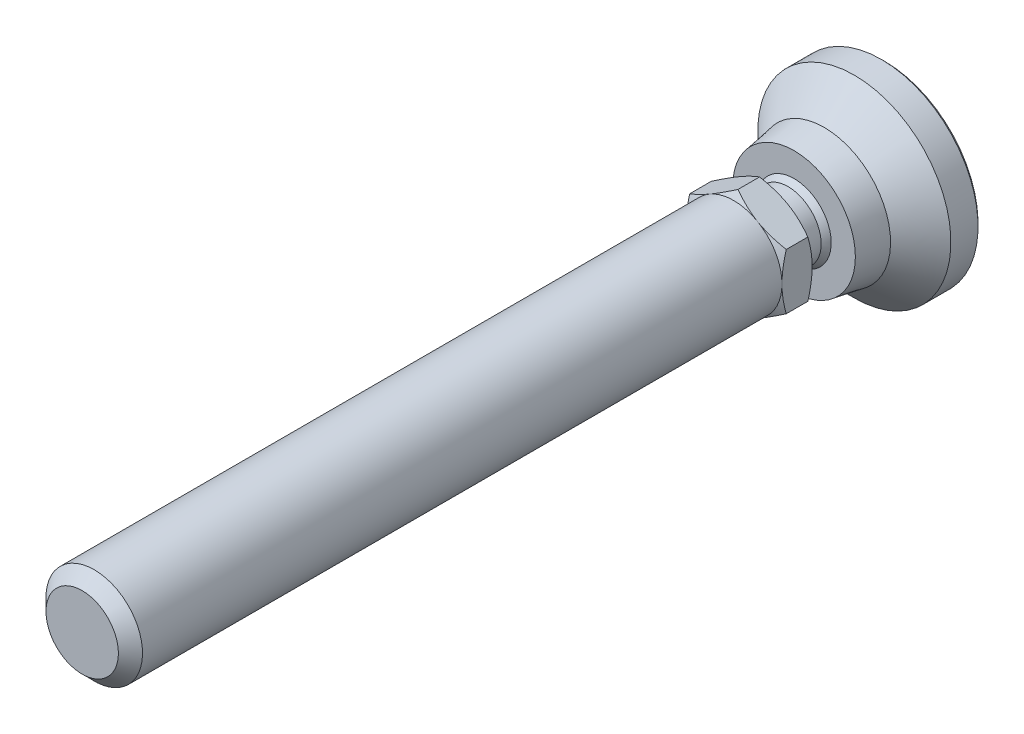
ISO-10303-21;
HEADER;
FILE_DESCRIPTION(('STEP AP214'),'2;1');
FILE_NAME('part.step','',(''),(''),'','','');
FILE_SCHEMA(('AUTOMOTIVE_DESIGN { 1 0 10303 214 1 1 1 1 }'));
ENDSEC;
DATA;
#1=APPLICATION_CONTEXT('core data for automotive mechanical design processes');
#2=APPLICATION_PROTOCOL_DEFINITION('international standard','automotive_design',2000,#1);
#3=PRODUCT_CONTEXT('',#1,'mechanical');
#4=PRODUCT('Part','Part','',(#3));
#5=PRODUCT_RELATED_PRODUCT_CATEGORY('part','',(#4));
#6=PRODUCT_DEFINITION_FORMATION('','',#4);
#7=PRODUCT_DEFINITION_CONTEXT('part definition',#1,'design');
#8=PRODUCT_DEFINITION('design','',#6,#7);
#9=PRODUCT_DEFINITION_SHAPE('','',#8);
#10=(LENGTH_UNIT() NAMED_UNIT(*) SI_UNIT(.MILLI.,.METRE.));
#11=(NAMED_UNIT(*) PLANE_ANGLE_UNIT() SI_UNIT($,.RADIAN.));
#12=(NAMED_UNIT(*) SI_UNIT($,.STERADIAN.) SOLID_ANGLE_UNIT());
#13=UNCERTAINTY_MEASURE_WITH_UNIT(LENGTH_MEASURE(1.E-05),#10,'distance_accuracy_value','');
#14=(GEOMETRIC_REPRESENTATION_CONTEXT(3) GLOBAL_UNCERTAINTY_ASSIGNED_CONTEXT((#13)) GLOBAL_UNIT_ASSIGNED_CONTEXT((#10,
#11,#12)) REPRESENTATION_CONTEXT('',''));
#15=CARTESIAN_POINT('',(0.,0.,0.));
#16=DIRECTION('',(0.,0.,1.));
#17=DIRECTION('',(1.,0.,0.));
#18=AXIS2_PLACEMENT_3D('',#15,#16,#17);
#19=CARTESIAN_POINT('',(-7.7647058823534,0.,20.));
#20=DIRECTION('',(0.,0.,1.));
#21=DIRECTION('',(0.,-1.,0.));
#22=AXIS2_PLACEMENT_3D('',#19,#20,#21);
#23=PLANE('',#22);
#24=CARTESIAN_POINT('',(0.,0.,20.));
#25=DIRECTION('',(0.,0.,-1.));
#26=DIRECTION('',(0.,1.,0.));
#27=AXIS2_PLACEMENT_3D('',#24,#25,#26);
#28=CIRCLE('',#27,5.50000000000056);
#29=CARTESIAN_POINT('',(0.,5.50000000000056,20.));
#30=VERTEX_POINT('',#29);
#31=EDGE_CURVE('E259',#30,#30,#28,.T.);
#32=ORIENTED_EDGE('',*,*,#31,.F.);
#33=EDGE_LOOP('',(#32));
#34=FACE_BOUND('',#33,.T.);
#35=CARTESIAN_POINT('',(0.,0.,20.));
#36=DIRECTION('',(0.,0.,1.));
#37=DIRECTION('',(0.,-1.,0.));
#38=AXIS2_PLACEMENT_3D('',#35,#36,#37);
#39=CIRCLE('',#38,8.);
#40=CARTESIAN_POINT('',(4.,-6.92820323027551,20.));
#41=VERTEX_POINT('',#40);
#42=CARTESIAN_POINT('',(8.,0.,20.));
#43=VERTEX_POINT('',#42);
#44=EDGE_CURVE('E9',#41,#43,#39,.T.);
#45=ORIENTED_EDGE('',*,*,#44,.F.);
#46=CARTESIAN_POINT('',(-4.,-6.92820323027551,20.));
#47=VERTEX_POINT('',#46);
#48=EDGE_CURVE('E17',#47,#41,#39,.T.);
#49=ORIENTED_EDGE('',*,*,#48,.F.);
#50=CARTESIAN_POINT('',(-8.,0.,20.));
#51=VERTEX_POINT('',#50);
#52=EDGE_CURVE('E124',#51,#47,#39,.T.);
#53=ORIENTED_EDGE('',*,*,#52,.F.);
#54=CARTESIAN_POINT('',(-4.,6.92820323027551,20.));
#55=VERTEX_POINT('',#54);
#56=EDGE_CURVE('E297',#55,#51,#39,.T.);
#57=ORIENTED_EDGE('',*,*,#56,.F.);
#58=CARTESIAN_POINT('',(4.,6.92820323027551,20.));
#59=VERTEX_POINT('',#58);
#60=EDGE_CURVE('E22',#59,#55,#39,.T.);
#61=ORIENTED_EDGE('',*,*,#60,.F.);
#62=CARTESIAN_POINT('',(0.,0.,20.));
#63=DIRECTION('',(0.,0.,-1.));
#64=DIRECTION('',(0.,1.,0.));
#65=AXIS2_PLACEMENT_3D('',#62,#63,#64);
#66=CIRCLE('',#65,8.);
#67=EDGE_CURVE('E127',#59,#43,#66,.T.);
#68=ORIENTED_EDGE('',*,*,#67,.T.);
#69=EDGE_LOOP('',(#45,#49,#53,#57,#61,#68));
#70=FACE_BOUND('',#69,.T.);
#71=ADVANCED_FACE('F14',(#34,#70),#23,.F.);
#72=CARTESIAN_POINT('',(0.,0.,0.));
#73=DIRECTION('',(0.,0.,-1.));
#74=DIRECTION('',(0.,1.,0.));
#75=AXIS2_PLACEMENT_3D('',#72,#73,#74);
#76=CYLINDRICAL_SURFACE('',#75,5.50000000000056);
#77=CARTESIAN_POINT('',(0.,0.,15.9999999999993));
#78=DIRECTION('',(0.,0.,-1.));
#79=DIRECTION('',(0.,1.,0.));
#80=AXIS2_PLACEMENT_3D('',#77,#78,#79);
#81=CIRCLE('',#80,5.50000000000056);
#82=CARTESIAN_POINT('',(0.,-5.50000000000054,15.9999999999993));
#83=VERTEX_POINT('',#82);
#84=EDGE_CURVE('E220',#83,#83,#81,.T.);
#85=ORIENTED_EDGE('',*,*,#84,.F.);
#86=EDGE_LOOP('',(#85));
#87=FACE_BOUND('',#86,.T.);
#88=ORIENTED_EDGE('',*,*,#31,.T.);
#89=EDGE_LOOP('',(#88));
#90=FACE_BOUND('',#89,.T.);
#91=ADVANCED_FACE('F373',(#87,#90),#76,.T.);
#92=CARTESIAN_POINT('',(0.,0.,11.6698729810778));
#93=DIRECTION('',(0.,0.,-1.));
#94=DIRECTION('',(0.,-1.,0.));
#95=AXIS2_PLACEMENT_3D('',#92,#93,#94);
#96=SPHERICAL_SURFACE('',#95,7.);
#97=CARTESIAN_POINT('',(0.,0.,15.));
#98=DIRECTION('',(0.,0.,-1.));
#99=DIRECTION('',(0.,1.,0.));
#100=AXIS2_PLACEMENT_3D('',#97,#98,#99);
#101=CIRCLE('',#100,6.15713034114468);
#102=CARTESIAN_POINT('',(0.,-6.15713034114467,15.));
#103=VERTEX_POINT('',#102);
#104=EDGE_CURVE('E227',#103,#103,#101,.T.);
#105=CARTESIAN_POINT('',(0.,-5.50000000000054,15.9999999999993));
#106=CARTESIAN_POINT('',(0.,-5.50771979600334,15.9901945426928));
#107=CARTESIAN_POINT('',(0.,-5.5154133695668,15.9803684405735));
#108=CARTESIAN_POINT('',(0.,-5.5307478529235,15.9606752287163));
#109=CARTESIAN_POINT('',(0.,-5.53838876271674,15.9508081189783));
#110=CARTESIAN_POINT('',(0.,-5.55361769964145,15.9310331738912));
#111=CARTESIAN_POINT('',(0.,-5.56120572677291,15.9211253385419));
#112=CARTESIAN_POINT('',(0.,-5.57632868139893,15.9012692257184));
#113=CARTESIAN_POINT('',(0.,-5.58386360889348,15.8913209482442));
#114=CARTESIAN_POINT('',(0.,-5.59888014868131,15.8713842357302));
#115=CARTESIAN_POINT('',(0.,-5.60636176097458,15.8613958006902));
#116=CARTESIAN_POINT('',(0.,-5.62127145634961,15.8413790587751));
#117=CARTESIAN_POINT('',(0.,-5.62869953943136,15.8313507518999));
#118=CARTESIAN_POINT('',(0.,-5.64350196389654,15.8112545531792));
#119=CARTESIAN_POINT('',(0.,-5.65087630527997,15.8011866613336));
#120=CARTESIAN_POINT('',(0.,-5.66557103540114,15.7810115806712));
#121=CARTESIAN_POINT('',(0.,-5.67289142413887,15.7709043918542));
#122=CARTESIAN_POINT('',(0.,-5.68747803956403,15.7506510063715));
#123=CARTESIAN_POINT('',(0.,-5.69474426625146,15.7405048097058));
#124=CARTESIAN_POINT('',(0.,-5.70922234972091,15.7201736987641));
#125=CARTESIAN_POINT('',(0.,-5.71643420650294,15.7099887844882));
#126=CARTESIAN_POINT('',(0.,-5.73080334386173,15.6895805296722));
#127=CARTESIAN_POINT('',(0.,-5.73796062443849,15.6793571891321));
#128=CARTESIAN_POINT('',(0.,-5.75222040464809,15.6588723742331));
#129=CARTESIAN_POINT('',(0.,-5.75932290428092,15.6486108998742));
#130=CARTESIAN_POINT('',(0.,-5.77347291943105,15.6280501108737));
#131=CARTESIAN_POINT('',(0.,-5.78052043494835,15.6177507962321));
#132=CARTESIAN_POINT('',(0.,-5.79456028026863,15.5971146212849));
#133=CARTESIAN_POINT('',(0.,-5.80155261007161,15.5867777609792));
#134=CARTESIAN_POINT('',(0.,-5.81548188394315,15.5660667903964));
#135=CARTESIAN_POINT('',(0.,-5.82241882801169,15.5556926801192));
#136=CARTESIAN_POINT('',(0.,-5.83623713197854,15.5349075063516));
#137=CARTESIAN_POINT('',(0.,-5.84311849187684,15.5244964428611));
#138=CARTESIAN_POINT('',(0.,-5.85682543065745,15.503637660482));
#139=CARTESIAN_POINT('',(0.,-5.86365100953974,15.4931899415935));
#140=CARTESIAN_POINT('',(0.,-5.8772461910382,15.4722581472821));
#141=CARTESIAN_POINT('',(0.,-5.88401579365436,15.4617740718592));
#142=CARTESIAN_POINT('',(0.,-5.89749882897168,15.440769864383));
#143=CARTESIAN_POINT('',(0.,-5.90421226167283,15.4302497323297));
#144=CARTESIAN_POINT('',(0.,-5.91758276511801,15.4091737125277));
#145=CARTESIAN_POINT('',(0.,-5.92423983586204,15.398617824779));
#146=CARTESIAN_POINT('',(0.,-5.93749742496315,15.3774705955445));
#147=CARTESIAN_POINT('',(0.,-5.94409794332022,15.3668792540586));
#148=CARTESIAN_POINT('',(0.,-5.9572422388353,15.3456614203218));
#149=CARTESIAN_POINT('',(0.,-5.96378601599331,15.3350349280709));
#150=CARTESIAN_POINT('',(0.,-5.97681664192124,15.3137470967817));
#151=CARTESIAN_POINT('',(0.,-5.98330349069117,15.3030857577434));
#152=CARTESIAN_POINT('',(0.,-5.99622007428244,15.2817285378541));
#153=CARTESIAN_POINT('',(0.,-6.00264980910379,15.271032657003));
#154=CARTESIAN_POINT('',(0.,-6.0154519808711,15.2496066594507));
#155=CARTESIAN_POINT('',(0.,-6.02182441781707,15.2388765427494));
#156=CARTESIAN_POINT('',(0.,-6.03451181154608,15.2173823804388));
#157=CARTESIAN_POINT('',(0.,-6.04082676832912,15.2066183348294));
#158=CARTESIAN_POINT('',(0.,-6.05339902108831,15.1850566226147));
#159=CARTESIAN_POINT('',(0.,-6.05965631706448,15.1742589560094));
#160=CARTESIAN_POINT('',(0.,-6.07211306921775,15.1526303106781));
#161=CARTESIAN_POINT('',(0.,-6.07831252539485,15.1417993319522));
#162=CARTESIAN_POINT('',(0.,-6.09065342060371,15.1201043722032));
#163=CARTESIAN_POINT('',(0.,-6.09679485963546,15.1092403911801));
#164=CARTESIAN_POINT('',(0.,-6.10901954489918,15.0874797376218));
#165=CARTESIAN_POINT('',(0.,-6.11510279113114,15.0765830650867));
#166=CARTESIAN_POINT('',(0.,-6.12721091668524,15.0547573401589));
#167=CARTESIAN_POINT('',(0.,-6.13323579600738,15.0438282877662));
#168=CARTESIAN_POINT('',(0.,-6.14522701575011,15.0219381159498));
#169=CARTESIAN_POINT('',(0.,-6.15119335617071,15.010976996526));
#170=CARTESIAN_POINT('',(0.,-6.15713034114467,15.));
#171=B_SPLINE_CURVE_WITH_KNOTS('',3,(#105,#106,#107,#108,#109,#110,#111,#112,#113,#114,#115,
#116,#117,#118,#119,#120,#121,#122,#123,#124,#125,#126,#127,#128,#129,#130,#131,#132,#133,#134,
#135,#136,#137,#138,#139,#140,#141,#142,#143,#144,#145,#146,#147,#148,#149,#150,#151,#152,#153,
#154,#155,#156,#157,#158,#159,#160,#161,#162,#163,#164,#165,#166,#167,#168,#169,#170),
.UNSPECIFIED.,.F.,.F.,(4,2,2,2,2,2,2,2,2,2,2,2,2,2,2,2,2,2,2,2,2,2,2,2,2,2,2,2,2,2,2,2,4),(0.,
0.0374389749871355,0.0748779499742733,0.11231692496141,0.149755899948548,0.187194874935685,
0.224633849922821,0.262072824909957,0.299511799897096,0.336950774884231,0.374389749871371,
0.411828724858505,0.449267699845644,0.486706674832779,0.524145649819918,0.561584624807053,
0.59902359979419,0.636462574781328,0.673901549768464,0.711340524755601,0.748779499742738,
0.786218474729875,0.823657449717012,0.86109642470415,0.898535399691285,0.935974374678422,
0.973413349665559,1.0108523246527,1.04829129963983,1.08573027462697,1.12316924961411,
1.16060822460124,1.19804719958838),.UNSPECIFIED.);
#172=EDGE_CURVE('BSEAM379',#83,#103,#171,.T.);
#173=ORIENTED_EDGE('',*,*,#84,.T.);
#174=ORIENTED_EDGE('',*,*,#104,.F.);
#175=ORIENTED_EDGE('',*,*,#172,.T.);
#176=ORIENTED_EDGE('',*,*,#172,.F.);
#177=EDGE_LOOP('',(#173,#175,#174,#176));
#178=FACE_BOUND('',#177,.T.);
#179=ADVANCED_FACE('F379',(#178),#96,.T.);
#180=CARTESIAN_POINT('',(-15.5,0.,0.));
#181=DIRECTION('',(0.,0.,1.));
#182=DIRECTION('',(0.,-1.,0.));
#183=AXIS2_PLACEMENT_3D('',#180,#181,#182);
#184=PLANE('',#183);
#185=CARTESIAN_POINT('',(0.,0.,0.));
#186=DIRECTION('',(0.,0.,-1.));
#187=DIRECTION('',(0.,1.,0.));
#188=AXIS2_PLACEMENT_3D('',#185,#186,#187);
#189=CIRCLE('',#188,15.5);
#190=CARTESIAN_POINT('',(0.,15.5,0.));
#191=VERTEX_POINT('',#190);
#192=EDGE_CURVE('E248',#191,#191,#189,.T.);
#193=ORIENTED_EDGE('',*,*,#192,.T.);
#194=EDGE_LOOP('',(#193));
#195=FACE_BOUND('',#194,.T.);
#196=ADVANCED_FACE('F195',(#195),#184,.F.);
#197=CARTESIAN_POINT('',(0.,0.,0.500000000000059));
#198=DIRECTION('',(0.,0.,1.));
#199=DIRECTION('',(0.,-1.,0.));
#200=AXIS2_PLACEMENT_3D('',#197,#198,#199);
#201=CONICAL_SURFACE('',#200,16.,0.785398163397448);
#202=ORIENTED_EDGE('',*,*,#192,.F.);
#203=EDGE_LOOP('',(#202));
#204=FACE_BOUND('',#203,.T.);
#205=CARTESIAN_POINT('',(0.,0.,0.500000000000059));
#206=DIRECTION('',(0.,0.,-1.));
#207=DIRECTION('',(0.,1.,0.));
#208=AXIS2_PLACEMENT_3D('',#205,#206,#207);
#209=CIRCLE('',#208,16.);
#210=CARTESIAN_POINT('',(0.,16.,0.500000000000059));
#211=VERTEX_POINT('',#210);
#212=EDGE_CURVE('E251',#211,#211,#209,.T.);
#213=ORIENTED_EDGE('',*,*,#212,.T.);
#214=EDGE_LOOP('',(#213));
#215=FACE_BOUND('',#214,.T.);
#216=ADVANCED_FACE('F398',(#204,#215),#201,.T.);
#217=CARTESIAN_POINT('',(0.,0.,0.));
#218=DIRECTION('',(0.,0.,-1.));
#219=DIRECTION('',(0.,1.,0.));
#220=AXIS2_PLACEMENT_3D('',#217,#218,#219);
#221=CYLINDRICAL_SURFACE('',#220,16.);
#222=ORIENTED_EDGE('',*,*,#212,.F.);
#223=EDGE_LOOP('',(#222));
#224=FACE_BOUND('',#223,.T.);
#225=CARTESIAN_POINT('',(0.,0.,5.));
#226=DIRECTION('',(0.,0.,-1.));
#227=DIRECTION('',(0.,1.,0.));
#228=AXIS2_PLACEMENT_3D('',#225,#226,#227);
#229=CIRCLE('',#228,16.);
#230=CARTESIAN_POINT('',(0.,16.,5.));
#231=VERTEX_POINT('',#230);
#232=EDGE_CURVE('E254',#231,#231,#229,.T.);
#233=ORIENTED_EDGE('',*,*,#232,.T.);
#234=EDGE_LOOP('',(#233));
#235=FACE_BOUND('',#234,.T.);
#236=ADVANCED_FACE('F395',(#224,#235),#221,.T.);
#237=CARTESIAN_POINT('',(0.,0.,10.));
#238=DIRECTION('',(0.,0.,-1.));
#239=DIRECTION('',(0.,1.,0.));
#240=AXIS2_PLACEMENT_3D('',#237,#238,#239);
#241=CONICAL_SURFACE('',#240,11.,0.785398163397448);
#242=ORIENTED_EDGE('',*,*,#232,.F.);
#243=EDGE_LOOP('',(#242));
#244=FACE_BOUND('',#243,.T.);
#245=CARTESIAN_POINT('',(0.,0.,10.));
#246=DIRECTION('',(0.,0.,-1.));
#247=DIRECTION('',(0.,1.,0.));
#248=AXIS2_PLACEMENT_3D('',#245,#246,#247);
#249=CIRCLE('',#248,11.);
#250=CARTESIAN_POINT('',(0.,11.,10.));
#251=VERTEX_POINT('',#250);
#252=EDGE_CURVE('E257',#251,#251,#249,.T.);
#253=ORIENTED_EDGE('',*,*,#252,.T.);
#254=EDGE_LOOP('',(#253));
#255=FACE_BOUND('',#254,.T.);
#256=ADVANCED_FACE('F391',(#244,#255),#241,.T.);
#257=CARTESIAN_POINT('',(0.,0.,16.));
#258=DIRECTION('',(0.,0.,-1.));
#259=DIRECTION('',(0.,1.,0.));
#260=AXIS2_PLACEMENT_3D('',#257,#258,#259);
#261=CONICAL_SURFACE('',#260,10.,0.165148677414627);
#262=CARTESIAN_POINT('',(0.,0.,15.));
#263=DIRECTION('',(0.,0.,1.));
#264=DIRECTION('',(0.,-1.,0.));
#265=AXIS2_PLACEMENT_3D('',#262,#263,#264);
#266=CIRCLE('',#265,10.1666666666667);
#267=CARTESIAN_POINT('',(0.,-10.1666666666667,15.));
#268=VERTEX_POINT('',#267);
#269=EDGE_CURVE('E230',#268,#268,#266,.T.);
#270=ORIENTED_EDGE('',*,*,#269,.F.);
#271=EDGE_LOOP('',(#270));
#272=FACE_BOUND('',#271,.T.);
#273=ORIENTED_EDGE('',*,*,#252,.F.);
#274=EDGE_LOOP('',(#273));
#275=FACE_BOUND('',#274,.T.);
#276=ADVANCED_FACE('F388',(#272,#275),#261,.T.);
#277=CARTESIAN_POINT('',(-6.60079601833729,0.,15.));
#278=DIRECTION('',(0.,0.,-1.));
#279=DIRECTION('',(0.,1.,0.));
#280=AXIS2_PLACEMENT_3D('',#277,#278,#279);
#281=PLANE('',#280);
#282=ORIENTED_EDGE('',*,*,#269,.T.);
#283=EDGE_LOOP('',(#282));
#284=FACE_BOUND('',#283,.T.);
#285=ORIENTED_EDGE('',*,*,#104,.T.);
#286=EDGE_LOOP('',(#285));
#287=FACE_BOUND('',#286,.T.);
#288=ADVANCED_FACE('F325',(#284,#287),#281,.F.);
#289=CARTESIAN_POINT('',(0.,0.,20.));
#290=DIRECTION('',(0.,0.,1.));
#291=DIRECTION('',(0.,-1.,0.));
#292=AXIS2_PLACEMENT_3D('',#289,#290,#291);
#293=CONICAL_SURFACE('',#292,8.,1.0471975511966);
#294=CARTESIAN_POINT('',(8.0002,-4.6186866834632,20.714597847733));
#295=CARTESIAN_POINT('',(7.82435121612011,-4.72021302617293,20.6559907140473));
#296=CARTESIAN_POINT('',(7.64784680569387,-4.82211789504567,20.6000434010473));
#297=CARTESIAN_POINT('',(7.29340453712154,-5.02675523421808,20.4942010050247));
#298=CARTESIAN_POINT('',(7.11546609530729,-5.12948804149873,20.4443085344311));
#299=CARTESIAN_POINT('',(6.57880176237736,-5.43933133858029,20.3046927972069));
#300=CARTESIAN_POINT('',(6.21795741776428,-5.64766491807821,20.2252811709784));
#301=CARTESIAN_POINT('',(5.67796082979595,-5.9594320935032,20.1321616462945));
#302=CARTESIAN_POINT('',(5.50042181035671,-6.06193429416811,20.1056345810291));
#303=CARTESIAN_POINT('',(5.1445408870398,-6.26740224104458,20.0611531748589));
#304=CARTESIAN_POINT('',(4.96619905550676,-6.37036794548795,20.0431980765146));
#305=CARTESIAN_POINT('',(4.6092083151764,-6.57647664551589,20.0163156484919));
#306=CARTESIAN_POINT('',(4.4305599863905,-6.67961930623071,20.0073780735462));
#307=CARTESIAN_POINT('',(4.07309829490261,-6.88599991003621,19.9987223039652));
#308=CARTESIAN_POINT('',(3.89428493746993,-6.98923785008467,19.9990038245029));
#309=CARTESIAN_POINT('',(3.55998663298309,-7.18224506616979,20.0081450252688));
#310=CARTESIAN_POINT('',(3.40447809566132,-7.27202796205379,20.0158896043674));
#311=CARTESIAN_POINT('',(3.09382523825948,-7.45138347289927,20.0382011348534));
#312=CARTESIAN_POINT('',(2.93868094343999,-7.54095607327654,20.0527685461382));
#313=CARTESIAN_POINT('',(2.47384868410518,-7.80932710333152,20.1063606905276));
#314=CARTESIAN_POINT('',(2.16498351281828,-7.98765049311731,20.1552686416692));
#315=CARTESIAN_POINT('',(1.5439767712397,-8.34618890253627,20.2775394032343));
#316=CARTESIAN_POINT('',(1.23191445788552,-8.52635816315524,20.351420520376));
#317=CARTESIAN_POINT('',(0.61244351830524,-8.88400987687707,20.519100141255));
#318=CARTESIAN_POINT('',(0.305026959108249,-9.0614969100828,20.6128592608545));
#319=CARTESIAN_POINT('',(-0.000199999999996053,-9.23771977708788,20.714597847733));
#320=B_SPLINE_CURVE_WITH_KNOTS('',3,(#294,#295,#296,#297,#298,#299,#300,#301,#302,#303,#304,
#305,#306,#307,#308,#309,#310,#311,#312,#313,#314,#315,#316,#317,#318,#319),.UNSPECIFIED.,.F.,
.F.,(4,2,2,2,2,2,2,2,2,2,2,2,4),(0.,0.633973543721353,1.26821965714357,2.53934712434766,
3.15934343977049,3.77928496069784,4.39852133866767,5.01773858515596,5.5568023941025,
6.09590254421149,7.17487077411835,8.27776850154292,9.37850115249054),.UNSPECIFIED.);
#321=CARTESIAN_POINT('',(0.,-9.23760430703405,20.7145311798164));
#322=VERTEX_POINT('',#321);
#323=EDGE_CURVE('E114',#41,#322,#320,.T.);
#324=ORIENTED_EDGE('',*,*,#323,.T.);
#325=CARTESIAN_POINT('',(0.000200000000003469,-9.23771977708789,20.714597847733));
#326=CARTESIAN_POINT('',(-0.175648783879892,-9.13619343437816,20.6559907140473));
#327=CARTESIAN_POINT('',(-0.35215319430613,-9.03428856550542,20.6000434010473));
#328=CARTESIAN_POINT('',(-0.706595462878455,-8.829651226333,20.4942010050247));
#329=CARTESIAN_POINT('',(-0.884533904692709,-8.72691841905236,20.4443085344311));
#330=CARTESIAN_POINT('',(-1.42119823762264,-8.41707512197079,20.3046927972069));
#331=CARTESIAN_POINT('',(-1.78204258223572,-8.20874154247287,20.2252811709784));
#332=CARTESIAN_POINT('',(-2.32203917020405,-7.89697436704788,20.1321616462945));
#333=CARTESIAN_POINT('',(-2.49957818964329,-7.79447216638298,20.1056345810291));
#334=CARTESIAN_POINT('',(-2.8554591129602,-7.5890042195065,20.0611531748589));
#335=CARTESIAN_POINT('',(-3.03380094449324,-7.48603851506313,20.0431980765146));
#336=CARTESIAN_POINT('',(-3.3907916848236,-7.27992981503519,20.0163156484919));
#337=CARTESIAN_POINT('',(-3.56944001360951,-7.17678715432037,20.0073780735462));
#338=CARTESIAN_POINT('',(-3.92690170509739,-6.97040655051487,19.9987223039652));
#339=CARTESIAN_POINT('',(-4.10571506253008,-6.86716861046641,19.9990038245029));
#340=CARTESIAN_POINT('',(-4.44001336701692,-6.6741613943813,20.0081450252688));
#341=CARTESIAN_POINT('',(-4.59552190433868,-6.58437849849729,20.0158896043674));
#342=CARTESIAN_POINT('',(-4.90617476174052,-6.40502298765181,20.0382011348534));
#343=CARTESIAN_POINT('',(-5.06131905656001,-6.31545038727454,20.0527685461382));
#344=CARTESIAN_POINT('',(-5.52615131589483,-6.04707935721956,20.1063606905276));
#345=CARTESIAN_POINT('',(-5.83501648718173,-5.86875596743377,20.1552686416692));
#346=CARTESIAN_POINT('',(-6.45602322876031,-5.51021755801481,20.2775394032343));
#347=CARTESIAN_POINT('',(-6.76808554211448,-5.33004829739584,20.351420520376));
#348=CARTESIAN_POINT('',(-7.38755648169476,-4.97239658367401,20.519100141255));
#349=CARTESIAN_POINT('',(-7.69497304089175,-4.79490955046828,20.6128592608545));
#350=CARTESIAN_POINT('',(-8.0002,-4.6186866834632,20.714597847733));
#351=B_SPLINE_CURVE_WITH_KNOTS('',3,(#325,#326,#327,#328,#329,#330,#331,#332,#333,#334,#335,
#336,#337,#338,#339,#340,#341,#342,#343,#344,#345,#346,#347,#348,#349,#350),.UNSPECIFIED.,.F.,
.F.,(4,2,2,2,2,2,2,2,2,2,2,2,4),(0.,0.633973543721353,1.26821965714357,2.53934712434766,
3.1593434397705,3.77928496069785,4.39852133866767,5.01773858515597,5.5568023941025,
6.09590254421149,7.17487077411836,8.27776850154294,9.37850115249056),.UNSPECIFIED.);
#352=EDGE_CURVE('E121',#322,#47,#351,.T.);
#353=ORIENTED_EDGE('',*,*,#352,.T.);
#354=ORIENTED_EDGE('',*,*,#48,.T.);
#355=EDGE_LOOP('',(#324,#353,#354));
#356=FACE_BOUND('',#355,.T.);
#357=ADVANCED_FACE('F119',(#356),#293,.T.);
#358=CARTESIAN_POINT('',(-8.,-4.61880215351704,20.7145311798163));
#359=VERTEX_POINT('',#358);
#360=EDGE_CURVE('E185',#47,#359,#351,.T.);
#361=ORIENTED_EDGE('',*,*,#360,.T.);
#362=CARTESIAN_POINT('',(-8.,12.3494240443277,23.8764568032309));
#363=CARTESIAN_POINT('',(-8.,12.0004925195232,23.7074247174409));
#364=CARTESIAN_POINT('',(-8.,11.6507538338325,23.5400300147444));
#365=CARTESIAN_POINT('',(-8.,10.9492326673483,23.2094374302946));
#366=CARTESIAN_POINT('',(-8.,10.5974498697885,23.0462402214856));
#367=CARTESIAN_POINT('',(-8.,9.88957083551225,22.724131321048));
#368=CARTESIAN_POINT('',(-8.,9.53346150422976,22.5652483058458));
#369=CARTESIAN_POINT('',(-8.,8.81839046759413,22.2540611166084));
#370=CARTESIAN_POINT('',(-8.,8.45942889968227,22.1017566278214));
#371=CARTESIAN_POINT('',(-8.,7.72670794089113,21.8007932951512));
#372=CARTESIAN_POINT('',(-8.,7.35283865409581,21.6524005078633));
#373=CARTESIAN_POINT('',(-8.,6.60070583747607,21.3669850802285));
#374=CARTESIAN_POINT('',(-8.,6.22244181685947,21.229963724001));
#375=CARTESIAN_POINT('',(-8.,5.46163992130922,20.9709307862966));
#376=CARTESIAN_POINT('',(-8.,5.07911267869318,20.8488883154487));
#377=CARTESIAN_POINT('',(-8.,4.30858543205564,20.623765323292));
#378=CARTESIAN_POINT('',(-8.,3.92058721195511,20.5206787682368));
#379=CARTESIAN_POINT('',(-8.,3.14098104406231,20.3390059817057));
#380=CARTESIAN_POINT('',(-8.,2.74940448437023,20.2602887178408));
#381=CARTESIAN_POINT('',(-8.,2.15852002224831,20.1639248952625));
#382=CARTESIAN_POINT('',(-8.,1.96095694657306,20.1354209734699));
#383=CARTESIAN_POINT('',(-8.,1.56486840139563,20.0862108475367));
#384=CARTESIAN_POINT('',(-8.,1.36634302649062,20.0655038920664));
#385=CARTESIAN_POINT('',(-8.,0.971163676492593,20.032556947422));
#386=CARTESIAN_POINT('',(-8.,0.774518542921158,20.0202113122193));
#387=CARTESIAN_POINT('',(-8.,0.38088267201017,20.0038428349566));
#388=CARTESIAN_POINT('',(-8.,0.183891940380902,19.9998198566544));
#389=CARTESIAN_POINT('',(-8.,-0.210083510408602,20.0001925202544));
#390=CARTESIAN_POINT('',(-8.,-0.407068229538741,20.0045881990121));
#391=CARTESIAN_POINT('',(-8.,-0.80067906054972,20.0216917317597));
#392=CARTESIAN_POINT('',(-8.,-0.997305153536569,20.0344000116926));
#393=CARTESIAN_POINT('',(-8.,-1.47161886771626,20.0748150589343));
#394=CARTESIAN_POINT('',(-8.,-1.7489691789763,20.106563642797));
#395=CARTESIAN_POINT('',(-8.,-2.30156033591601,20.1848541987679));
#396=CARTESIAN_POINT('',(-8.,-2.57680088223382,20.2313982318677));
#397=CARTESIAN_POINT('',(-8.,-3.39907268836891,20.3907510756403));
#398=CARTESIAN_POINT('',(-8.,-3.94233573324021,20.5232499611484));
#399=CARTESIAN_POINT('',(-8.,-4.75455977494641,20.7523667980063));
#400=CARTESIAN_POINT('',(-8.,-5.02775033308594,20.8348477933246));
#401=CARTESIAN_POINT('',(-8.,-5.57147708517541,21.0082160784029));
#402=CARTESIAN_POINT('',(-8.,-5.8420132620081,21.0991034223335));
#403=CARTESIAN_POINT('',(-8.,-6.38051923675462,21.2878395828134));
#404=CARTESIAN_POINT('',(-8.,-6.64848988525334,21.3856859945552));
#405=CARTESIAN_POINT('',(-8.,-7.18222210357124,21.5872051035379));
#406=CARTESIAN_POINT('',(-8.,-7.44798369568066,21.6908777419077));
#407=CARTESIAN_POINT('',(-8.,-8.05998807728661,21.9361157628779));
#408=CARTESIAN_POINT('',(-8.,-8.40552865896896,22.0794299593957));
#409=CARTESIAN_POINT('',(-8.,-9.09378962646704,22.3726959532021));
#410=CARTESIAN_POINT('',(-8.,-9.43650985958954,22.5226481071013));
#411=CARTESIAN_POINT('',(-8.,-10.1196286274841,22.8278997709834));
#412=CARTESIAN_POINT('',(-8.,-10.4600267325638,22.9832002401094));
#413=CARTESIAN_POINT('',(-8.,-11.1388259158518,23.2981133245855));
#414=CARTESIAN_POINT('',(-8.,-11.4772269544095,23.4577260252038));
#415=CARTESIAN_POINT('',(-8.,-12.152674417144,23.7806343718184));
#416=CARTESIAN_POINT('',(-8.,-12.4897191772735,23.9439334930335));
#417=CARTESIAN_POINT('',(-8.,-13.1623788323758,24.2734531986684));
#418=CARTESIAN_POINT('',(-8.,-13.4979937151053,24.4396738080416));
#419=CARTESIAN_POINT('',(-8.,-14.5029447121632,24.9419226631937));
#420=CARTESIAN_POINT('',(-8.,-15.1704684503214,25.281577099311));
#421=CARTESIAN_POINT('',(-8.,-16.4486015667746,25.9402494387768));
#422=CARTESIAN_POINT('',(-8.,-17.0594842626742,26.258739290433));
#423=CARTESIAN_POINT('',(-8.,-18.2789555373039,26.9001243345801));
#424=CARTESIAN_POINT('',(-7.99999999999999,-18.8875440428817,27.2230196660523));
#425=CARTESIAN_POINT('',(-7.99999999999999,-20.1015074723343,27.8714271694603));
#426=CARTESIAN_POINT('',(-7.99999999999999,-20.7068865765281,28.196931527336));
#427=CARTESIAN_POINT('',(-7.99999999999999,-21.9161684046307,28.8505982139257));
#428=CARTESIAN_POINT('',(-8.,-22.5200712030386,29.1787604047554));
#429=CARTESIAN_POINT('',(-8.,-23.1234261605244,29.5079200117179));
#430=B_SPLINE_CURVE_WITH_KNOTS('',3,(#362,#363,#364,#365,#366,#367,#368,#369,#370,#371,#372,
#373,#374,#375,#376,#377,#378,#379,#380,#381,#382,#383,#384,#385,#386,#387,#388,#389,#390,#391,
#392,#393,#394,#395,#396,#397,#398,#399,#400,#401,#402,#403,#404,#405,#406,#407,#408,#409,#410,
#411,#412,#413,#414,#415,#416,#417,#418,#419,#420,#421,#422,#423,#424,#425,#426,#427,#428,#429),
.UNSPECIFIED.,.F.,.F.,(4,2,2,2,2,2,2,2,2,2,2,2,2,2,2,2,2,2,2,2,2,2,2,2,2,2,2,2,2,2,2,2,2,4),(0.,
1.1631677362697,2.32652080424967,3.49630469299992,4.66603255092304,5.87261519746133,
7.07933391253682,8.28352076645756,9.48732365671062,10.684536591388,11.2832330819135,
11.8818718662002,12.4727981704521,13.0637148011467,13.6546340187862,14.2455835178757,
15.082593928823,15.919720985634,17.5949303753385,18.4509719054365,19.3070189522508,
20.1627716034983,21.0185156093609,22.1406694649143,23.2628836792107,24.3853002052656,
25.5077389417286,26.6312840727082,27.7548388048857,30.0016776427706,32.0684242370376,
34.1352361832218,36.1972505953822,38.2591587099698),.UNSPECIFIED.);
#431=EDGE_CURVE('E288',#359,#51,#430,.F.);
#432=ORIENTED_EDGE('',*,*,#431,.T.);
#433=ORIENTED_EDGE('',*,*,#52,.T.);
#434=EDGE_LOOP('',(#361,#432,#433));
#435=FACE_BOUND('',#434,.T.);
#436=ADVANCED_FACE('F469',(#435),#293,.T.);
#437=CARTESIAN_POINT('',(-8.0002,4.61868668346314,20.7145978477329));
#438=CARTESIAN_POINT('',(-7.8243512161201,4.72021302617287,20.6559907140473));
#439=CARTESIAN_POINT('',(-7.64784680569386,4.82211789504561,20.6000434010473));
#440=CARTESIAN_POINT('',(-7.29340453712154,5.02675523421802,20.4942010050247));
#441=CARTESIAN_POINT('',(-7.11546609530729,5.12948804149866,20.4443085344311));
#442=CARTESIAN_POINT('',(-6.57880176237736,5.43933133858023,20.3046927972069));
#443=CARTESIAN_POINT('',(-6.21795741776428,5.64766491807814,20.2252811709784));
#444=CARTESIAN_POINT('',(-5.67796082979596,5.95943209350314,20.1321616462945));
#445=CARTESIAN_POINT('',(-5.50042181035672,6.06193429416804,20.1056345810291));
#446=CARTESIAN_POINT('',(-5.14454088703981,6.26740224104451,20.0611531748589));
#447=CARTESIAN_POINT('',(-4.96619905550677,6.37036794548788,20.0431980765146));
#448=CARTESIAN_POINT('',(-4.60920831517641,6.57647664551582,20.0163156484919));
#449=CARTESIAN_POINT('',(-4.43055998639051,6.67961930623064,20.0073780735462));
#450=CARTESIAN_POINT('',(-4.07309829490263,6.88599991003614,19.9987223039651));
#451=CARTESIAN_POINT('',(-3.89428493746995,6.9892378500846,19.9990038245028));
#452=CARTESIAN_POINT('',(-3.55998663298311,7.18224506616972,20.0081450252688));
#453=CARTESIAN_POINT('',(-3.40447809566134,7.27202796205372,20.0158896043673));
#454=CARTESIAN_POINT('',(-3.0938252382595,7.4513834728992,20.0382011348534));
#455=CARTESIAN_POINT('',(-2.93868094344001,7.54095607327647,20.0527685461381));
#456=CARTESIAN_POINT('',(-2.47384868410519,7.80932710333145,20.1063606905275));
#457=CARTESIAN_POINT('',(-2.16498351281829,7.98765049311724,20.1552686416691));
#458=CARTESIAN_POINT('',(-1.54397677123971,8.34618890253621,20.2775394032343));
#459=CARTESIAN_POINT('',(-1.23191445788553,8.52635816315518,20.351420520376));
#460=CARTESIAN_POINT('',(-0.612443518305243,8.88400987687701,20.5191001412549));
#461=CARTESIAN_POINT('',(-0.30502695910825,9.06149691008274,20.6128592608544));
#462=CARTESIAN_POINT('',(0.000199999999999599,9.23771977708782,20.7145978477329));
#463=B_SPLINE_CURVE_WITH_KNOTS('',3,(#437,#438,#439,#440,#441,#442,#443,#444,#445,#446,#447,
#448,#449,#450,#451,#452,#453,#454,#455,#456,#457,#458,#459,#460,#461,#462),.UNSPECIFIED.,.F.,
.F.,(4,2,2,2,2,2,2,2,2,2,2,2,4),(0.,0.633973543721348,1.26821965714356,2.53934712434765,
3.15934343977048,3.77928496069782,4.39852133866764,5.01773858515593,5.55680239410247,
6.09590254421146,7.17487077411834,8.27776850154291,9.37850115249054),.UNSPECIFIED.);
#464=CARTESIAN_POINT('',(-8.,4.61880215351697,20.7145311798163));
#465=VERTEX_POINT('',#464);
#466=EDGE_CURVE('E178',#465,#55,#463,.T.);
#467=ORIENTED_EDGE('',*,*,#466,.T.);
#468=ORIENTED_EDGE('',*,*,#56,.T.);
#469=EDGE_CURVE('E168',#51,#465,#430,.F.);
#470=ORIENTED_EDGE('',*,*,#469,.T.);
#471=EDGE_LOOP('',(#467,#468,#470));
#472=FACE_BOUND('',#471,.T.);
#473=ADVANCED_FACE('F161',(#472),#293,.T.);
#474=CARTESIAN_POINT('',(-0.000200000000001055,9.23771977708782,20.7145978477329));
#475=CARTESIAN_POINT('',(0.175648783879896,9.13619343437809,20.6559907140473));
#476=CARTESIAN_POINT('',(0.352153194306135,9.03428856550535,20.6000434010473));
#477=CARTESIAN_POINT('',(0.706595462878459,8.82965122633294,20.4942010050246));
#478=CARTESIAN_POINT('',(0.88453390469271,8.7269184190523,20.444308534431));
#479=CARTESIAN_POINT('',(1.42119823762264,8.41707512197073,20.3046927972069));
#480=CARTESIAN_POINT('',(1.78204258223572,8.20874154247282,20.2252811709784));
#481=CARTESIAN_POINT('',(2.32203917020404,7.89697436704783,20.1321616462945));
#482=CARTESIAN_POINT('',(2.49957818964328,7.79447216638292,20.1056345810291));
#483=CARTESIAN_POINT('',(2.85545911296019,7.58900421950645,20.0611531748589));
#484=CARTESIAN_POINT('',(3.03380094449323,7.48603851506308,20.0431980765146));
#485=CARTESIAN_POINT('',(3.39079168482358,7.27992981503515,20.0163156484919));
#486=CARTESIAN_POINT('',(3.56944001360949,7.17678715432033,20.0073780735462));
#487=CARTESIAN_POINT('',(3.92690170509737,6.97040655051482,19.9987223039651));
#488=CARTESIAN_POINT('',(4.10571506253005,6.86716861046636,19.9990038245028));
#489=CARTESIAN_POINT('',(4.44001336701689,6.67416139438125,20.0081450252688));
#490=CARTESIAN_POINT('',(4.59552190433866,6.58437849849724,20.0158896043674));
#491=CARTESIAN_POINT('',(4.9061747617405,6.40502298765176,20.0382011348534));
#492=CARTESIAN_POINT('',(5.06131905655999,6.31545038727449,20.0527685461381));
#493=CARTESIAN_POINT('',(5.52615131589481,6.04707935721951,20.1063606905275));
#494=CARTESIAN_POINT('',(5.83501648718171,5.86875596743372,20.1552686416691));
#495=CARTESIAN_POINT('',(6.45602322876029,5.51021755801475,20.2775394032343));
#496=CARTESIAN_POINT('',(6.76808554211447,5.33004829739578,20.351420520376));
#497=CARTESIAN_POINT('',(7.38755648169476,4.97239658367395,20.519100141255));
#498=CARTESIAN_POINT('',(7.69497304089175,4.79490955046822,20.6128592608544));
#499=CARTESIAN_POINT('',(8.0002,4.61868668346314,20.7145978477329));
#500=B_SPLINE_CURVE_WITH_KNOTS('',3,(#474,#475,#476,#477,#478,#479,#480,#481,#482,#483,#484,
#485,#486,#487,#488,#489,#490,#491,#492,#493,#494,#495,#496,#497,#498,#499),.UNSPECIFIED.,.F.,
.F.,(4,2,2,2,2,2,2,2,2,2,2,2,4),(0.,0.633973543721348,1.26821965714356,2.53934712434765,
3.15934343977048,3.77928496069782,4.39852133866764,5.01773858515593,5.55680239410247,
6.09590254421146,7.17487077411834,8.27776850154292,9.37850115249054),.UNSPECIFIED.);
#501=CARTESIAN_POINT('',(0.,9.23760430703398,20.7145311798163));
#502=VERTEX_POINT('',#501);
#503=EDGE_CURVE('E36',#502,#59,#500,.T.);
#504=ORIENTED_EDGE('',*,*,#503,.T.);
#505=ORIENTED_EDGE('',*,*,#60,.T.);
#506=EDGE_CURVE('E133',#55,#502,#463,.T.);
#507=ORIENTED_EDGE('',*,*,#506,.T.);
#508=EDGE_LOOP('',(#504,#505,#507));
#509=FACE_BOUND('',#508,.T.);
#510=ADVANCED_FACE('F160',(#509),#293,.T.);
#511=CARTESIAN_POINT('',(8.,12.3494240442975,23.8764568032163));
#512=CARTESIAN_POINT('',(8.,12.000492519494,23.7074247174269));
#513=CARTESIAN_POINT('',(7.99999999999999,11.6507538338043,23.540030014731));
#514=CARTESIAN_POINT('',(7.99999999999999,10.9492326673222,23.2094374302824));
#515=CARTESIAN_POINT('',(7.99999999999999,10.5974498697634,23.0462402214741));
#516=CARTESIAN_POINT('',(7.99999999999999,9.88957083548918,22.7241313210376));
#517=CARTESIAN_POINT('',(7.99999999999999,9.53346150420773,22.5652483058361));
#518=CARTESIAN_POINT('',(7.99999999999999,8.81839046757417,22.2540611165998));
#519=CARTESIAN_POINT('',(7.99999999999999,8.45942889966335,22.1017566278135));
#520=CARTESIAN_POINT('',(7.99999999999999,7.72670794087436,21.8007932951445));
#521=CARTESIAN_POINT('',(7.99999999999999,7.35283865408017,21.6524005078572));
#522=CARTESIAN_POINT('',(7.99999999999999,6.60070583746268,21.3669850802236));
#523=CARTESIAN_POINT('',(8.,6.22244181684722,21.2299637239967));
#524=CARTESIAN_POINT('',(8.,5.46163992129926,20.9709307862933));
#525=CARTESIAN_POINT('',(7.99999999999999,5.07911267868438,20.848888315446));
#526=CARTESIAN_POINT('',(8.,4.30858543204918,20.6237653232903));
#527=CARTESIAN_POINT('',(8.,3.92058721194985,20.5206787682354));
#528=CARTESIAN_POINT('',(8.,3.14098104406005,20.3390059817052));
#529=CARTESIAN_POINT('',(8.,2.74940448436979,20.2602887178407));
#530=CARTESIAN_POINT('',(8.,2.15852002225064,20.1639248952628));
#531=CARTESIAN_POINT('',(8.,1.96095694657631,20.1354209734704));
#532=CARTESIAN_POINT('',(8.,1.56486840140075,20.0862108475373));
#533=CARTESIAN_POINT('',(8.,1.36634302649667,20.065503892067));
#534=CARTESIAN_POINT('',(8.,0.971163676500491,20.0325569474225));
#535=CARTESIAN_POINT('',(8.,0.77451854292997,20.0202113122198));
#536=CARTESIAN_POINT('',(8.,0.380882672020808,20.0038428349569));
#537=CARTESIAN_POINT('',(8.,0.183891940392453,19.9998198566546));
#538=CARTESIAN_POINT('',(8.,-0.210083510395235,20.0001925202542));
#539=CARTESIAN_POINT('',(8.,-0.40706822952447,20.0045881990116));
#540=CARTESIAN_POINT('',(8.,-0.800679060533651,20.0216917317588));
#541=CARTESIAN_POINT('',(8.,-0.997305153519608,20.0344000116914));
#542=CARTESIAN_POINT('',(8.,-1.47161886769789,20.0748150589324));
#543=CARTESIAN_POINT('',(8.,-1.74896917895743,20.1065636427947));
#544=CARTESIAN_POINT('',(8.,-2.30156033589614,20.1848541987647));
#545=CARTESIAN_POINT('',(8.,-2.57680088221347,20.2313982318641));
#546=CARTESIAN_POINT('',(8.,-3.39907268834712,20.3907510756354));
#547=CARTESIAN_POINT('',(8.,-3.9423357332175,20.5232499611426));
#548=CARTESIAN_POINT('',(8.,-4.75455977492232,20.7523667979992));
#549=CARTESIAN_POINT('',(8.,-5.02775033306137,20.834847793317));
#550=CARTESIAN_POINT('',(8.,-5.57147708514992,21.0082160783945));
#551=CARTESIAN_POINT('',(8.,-5.84201326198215,21.0991034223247));
#552=CARTESIAN_POINT('',(8.,-6.38051923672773,21.2878395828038));
#553=CARTESIAN_POINT('',(8.,-6.64848988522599,21.3856859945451));
#554=CARTESIAN_POINT('',(8.,-7.18222210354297,21.5872051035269));
#555=CARTESIAN_POINT('',(8.,-7.44798369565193,21.6908777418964));
#556=CARTESIAN_POINT('',(8.,-8.05998807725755,21.936115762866));
#557=CARTESIAN_POINT('',(8.,-8.40552865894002,22.0794299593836));
#558=CARTESIAN_POINT('',(8.,-9.09378962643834,22.3726959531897));
#559=CARTESIAN_POINT('',(8.,-9.43650985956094,22.5226481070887));
#560=CARTESIAN_POINT('',(8.,-10.1196286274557,22.8278997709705));
#561=CARTESIAN_POINT('',(8.,-10.4600267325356,22.9832002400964));
#562=CARTESIAN_POINT('',(8.,-11.1388259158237,23.2981133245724));
#563=CARTESIAN_POINT('',(8.,-11.4772269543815,23.4577260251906));
#564=CARTESIAN_POINT('',(8.,-12.1526744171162,23.780634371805));
#565=CARTESIAN_POINT('',(8.,-12.4897191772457,23.94393349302));
#566=CARTESIAN_POINT('',(8.,-13.1623788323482,24.2734531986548));
#567=CARTESIAN_POINT('',(8.,-13.4979937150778,24.4396738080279));
#568=CARTESIAN_POINT('',(8.,-14.5029447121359,24.9419226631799));
#569=CARTESIAN_POINT('',(8.,-15.1704684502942,25.2815770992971));
#570=CARTESIAN_POINT('',(8.,-16.4486015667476,25.9402494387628));
#571=CARTESIAN_POINT('',(8.00000000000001,-17.0594842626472,26.2587392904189));
#572=CARTESIAN_POINT('',(8.00000000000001,-18.278955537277,26.9001243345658));
#573=CARTESIAN_POINT('',(8.00000000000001,-18.8875440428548,27.223019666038));
#574=CARTESIAN_POINT('',(8.00000000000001,-20.1015074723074,27.8714271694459));
#575=CARTESIAN_POINT('',(8.00000000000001,-20.7068865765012,28.1969315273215));
#576=CARTESIAN_POINT('',(8.00000000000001,-21.9161684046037,28.8505982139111));
#577=CARTESIAN_POINT('',(8.00000000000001,-22.5200712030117,29.1787604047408));
#578=CARTESIAN_POINT('',(8.,-23.1234261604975,29.5079200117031));
#579=B_SPLINE_CURVE_WITH_KNOTS('',3,(#511,#512,#513,#514,#515,#516,#517,#518,#519,#520,#521,
#522,#523,#524,#525,#526,#527,#528,#529,#530,#531,#532,#533,#534,#535,#536,#537,#538,#539,#540,
#541,#542,#543,#544,#545,#546,#547,#548,#549,#550,#551,#552,#553,#554,#555,#556,#557,#558,#559,
#560,#561,#562,#563,#564,#565,#566,#567,#568,#569,#570,#571,#572,#573,#574,#575,#576,#577,#578),
.UNSPECIFIED.,.F.,.F.,(4,2,2,2,2,2,2,2,2,2,2,2,2,2,2,2,2,2,2,2,2,2,2,2,2,2,2,2,2,2,2,2,2,4),(0.,
1.16316773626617,2.3265208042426,3.49630469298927,4.66603255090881,5.87261519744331,
7.079333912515,8.28352076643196,9.48732365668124,10.684536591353,11.2832330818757,
11.8818718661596,12.4727981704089,13.0637148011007,13.6546340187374,14.2455835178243,
15.0825939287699,15.9197209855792,17.5949303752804,18.4509719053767,19.3070189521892,
20.1627716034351,21.018515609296,22.1406694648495,23.2628836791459,24.3853002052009,
25.5077389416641,26.6312840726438,27.7548388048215,30.0016776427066,32.0684242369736,
34.1352361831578,36.1972505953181,38.2591587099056),.UNSPECIFIED.);
#580=CARTESIAN_POINT('',(8.,4.61880215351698,20.7145311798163));
#581=VERTEX_POINT('',#580);
#582=EDGE_CURVE('E29',#581,#43,#579,.T.);
#583=ORIENTED_EDGE('',*,*,#582,.T.);
#584=ORIENTED_EDGE('',*,*,#67,.F.);
#585=EDGE_CURVE('E113',#59,#581,#500,.T.);
#586=ORIENTED_EDGE('',*,*,#585,.T.);
#587=EDGE_LOOP('',(#583,#584,#586));
#588=FACE_BOUND('',#587,.T.);
#589=ADVANCED_FACE('F156',(#588),#293,.T.);
#590=CARTESIAN_POINT('',(8.,-4.61880215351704,20.7145311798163));
#591=VERTEX_POINT('',#590);
#592=EDGE_CURVE('E108',#43,#591,#579,.T.);
#593=ORIENTED_EDGE('',*,*,#592,.T.);
#594=EDGE_CURVE('E102',#591,#41,#320,.T.);
#595=ORIENTED_EDGE('',*,*,#594,.T.);
#596=ORIENTED_EDGE('',*,*,#44,.T.);
#597=EDGE_LOOP('',(#593,#595,#596));
#598=FACE_BOUND('',#597,.T.);
#599=ADVANCED_FACE('F104',(#598),#293,.T.);
#600=CARTESIAN_POINT('',(0.,0.,133.));
#601=DIRECTION('',(0.,0.,-1.));
#602=DIRECTION('',(0.,1.,0.));
#603=AXIS2_PLACEMENT_3D('',#600,#601,#602);
#604=PLANE('',#603);
#605=CARTESIAN_POINT('',(0.,0.,133.));
#606=DIRECTION('',(0.,0.,-1.));
#607=DIRECTION('',(0.,1.,0.));
#608=AXIS2_PLACEMENT_3D('',#605,#606,#607);
#609=CIRCLE('',#608,6.);
#610=CARTESIAN_POINT('',(0.,6.,133.));
#611=VERTEX_POINT('',#610);
#612=EDGE_CURVE('E214',#611,#611,#609,.T.);
#613=ORIENTED_EDGE('',*,*,#612,.F.);
#614=EDGE_LOOP('',(#613));
#615=FACE_BOUND('',#614,.T.);
#616=ADVANCED_FACE('F500',(#615),#604,.F.);
#617=CARTESIAN_POINT('',(0.,0.,133.));
#618=DIRECTION('',(0.,0.,-1.));
#619=DIRECTION('',(0.,1.,0.));
#620=AXIS2_PLACEMENT_3D('',#617,#618,#619);
#621=CONICAL_SURFACE('',#620,6.,0.785398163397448);
#622=CARTESIAN_POINT('',(0.,0.,131.));
#623=DIRECTION('',(0.,0.,-1.));
#624=DIRECTION('',(0.,1.,0.));
#625=AXIS2_PLACEMENT_3D('',#622,#623,#624);
#626=CIRCLE('',#625,8.);
#627=CARTESIAN_POINT('',(0.,8.,131.));
#628=VERTEX_POINT('',#627);
#629=EDGE_CURVE('E217',#628,#628,#626,.T.);
#630=ORIENTED_EDGE('',*,*,#629,.F.);
#631=EDGE_LOOP('',(#630));
#632=FACE_BOUND('',#631,.T.);
#633=ORIENTED_EDGE('',*,*,#612,.T.);
#634=EDGE_LOOP('',(#633));
#635=FACE_BOUND('',#634,.T.);
#636=ADVANCED_FACE('F507',(#632,#635),#621,.T.);
#637=CARTESIAN_POINT('',(0.,0.,-2.68477183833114));
#638=DIRECTION('',(0.,0.,-1.));
#639=DIRECTION('',(0.,1.,0.));
#640=AXIS2_PLACEMENT_3D('',#637,#638,#639);
#641=CYLINDRICAL_SURFACE('',#640,8.);
#642=CARTESIAN_POINT('',(0.,0.,25.));
#643=DIRECTION('',(0.,0.,-1.));
#644=DIRECTION('',(0.,1.,0.));
#645=AXIS2_PLACEMENT_3D('',#642,#643,#644);
#646=CIRCLE('',#645,8.);
#647=CARTESIAN_POINT('',(4.,6.92820323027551,25.));
#648=VERTEX_POINT('',#647);
#649=CARTESIAN_POINT('',(8.,0.,25.));
#650=VERTEX_POINT('',#649);
#651=EDGE_CURVE('E312',#648,#650,#646,.T.);
#652=ORIENTED_EDGE('',*,*,#651,.F.);
#653=CARTESIAN_POINT('',(0.,0.,25.));
#654=DIRECTION('',(0.,0.,-1.));
#655=DIRECTION('',(0.,1.,0.));
#656=AXIS2_PLACEMENT_3D('',#653,#654,#655);
#657=CIRCLE('',#656,8.);
#658=CARTESIAN_POINT('',(-4.,6.92820323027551,25.));
#659=VERTEX_POINT('',#658);
#660=EDGE_CURVE('E224',#659,#648,#657,.T.);
#661=ORIENTED_EDGE('',*,*,#660,.F.);
#662=CARTESIAN_POINT('',(-8.,0.,25.));
#663=VERTEX_POINT('',#662);
#664=EDGE_CURVE('E264',#663,#659,#657,.T.);
#665=ORIENTED_EDGE('',*,*,#664,.F.);
#666=CARTESIAN_POINT('',(-4.,-6.92820323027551,25.));
#667=VERTEX_POINT('',#666);
#668=EDGE_CURVE('E269',#667,#663,#657,.T.);
#669=ORIENTED_EDGE('',*,*,#668,.F.);
#670=CARTESIAN_POINT('',(4.,-6.92820323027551,25.));
#671=VERTEX_POINT('',#670);
#672=EDGE_CURVE('E223',#671,#667,#657,.T.);
#673=ORIENTED_EDGE('',*,*,#672,.F.);
#674=EDGE_CURVE('E125',#650,#671,#657,.T.);
#675=ORIENTED_EDGE('',*,*,#674,.F.);
#676=EDGE_LOOP('',(#652,#661,#665,#669,#673,#675));
#677=FACE_BOUND('',#676,.T.);
#678=ORIENTED_EDGE('',*,*,#629,.T.);
#679=EDGE_LOOP('',(#678));
#680=FACE_BOUND('',#679,.T.);
#681=ADVANCED_FACE('F283',(#677,#680),#641,.T.);
#682=CARTESIAN_POINT('',(0.,0.,23.568821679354));
#683=DIRECTION('',(0.,0.,-1.));
#684=DIRECTION('',(0.,1.,0.));
#685=AXIS2_PLACEMENT_3D('',#682,#683,#684);
#686=CONICAL_SURFACE('',#685,10.47887356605,1.0471975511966);
#687=CARTESIAN_POINT('',(-8.0002,-4.6186866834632,24.285402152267));
#688=CARTESIAN_POINT('',(-7.8243512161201,-4.72021302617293,24.3440092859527));
#689=CARTESIAN_POINT('',(-7.64784680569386,-4.82211789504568,24.3999565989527));
#690=CARTESIAN_POINT('',(-7.29340453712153,-5.02675523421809,24.5057989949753));
#691=CARTESIAN_POINT('',(-7.11546609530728,-5.12948804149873,24.5556914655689));
#692=CARTESIAN_POINT('',(-6.57880176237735,-5.4393313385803,24.6953072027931));
#693=CARTESIAN_POINT('',(-6.21795741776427,-5.64766491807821,24.7747188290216));
#694=CARTESIAN_POINT('',(-5.67796082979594,-5.95943209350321,24.8678383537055));
#695=CARTESIAN_POINT('',(-5.50042181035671,-6.06193429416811,24.8943654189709));
#696=CARTESIAN_POINT('',(-5.14454088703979,-6.26740224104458,24.9388468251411));
#697=CARTESIAN_POINT('',(-4.96619905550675,-6.37036794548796,24.9568019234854));
#698=CARTESIAN_POINT('',(-4.6092083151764,-6.57647664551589,24.9836843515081));
#699=CARTESIAN_POINT('',(-4.43055998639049,-6.67961930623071,24.9926219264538));
#700=CARTESIAN_POINT('',(-4.07309829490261,-6.88599991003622,25.0012776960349));
#701=CARTESIAN_POINT('',(-3.89428493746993,-6.98923785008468,25.0009961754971));
#702=CARTESIAN_POINT('',(-3.55998663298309,-7.18224506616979,24.9918549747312));
#703=CARTESIAN_POINT('',(-3.40447809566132,-7.2720279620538,24.9841103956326));
#704=CARTESIAN_POINT('',(-3.09382523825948,-7.45138347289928,24.9617988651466));
#705=CARTESIAN_POINT('',(-2.93868094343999,-7.54095607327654,24.9472314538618));
#706=CARTESIAN_POINT('',(-2.47384868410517,-7.80932710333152,24.8936393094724));
#707=CARTESIAN_POINT('',(-2.16498351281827,-7.98765049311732,24.8447313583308));
#708=CARTESIAN_POINT('',(-1.54397677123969,-8.34618890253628,24.7224605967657));
#709=CARTESIAN_POINT('',(-1.23191445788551,-8.52635816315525,24.648579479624));
#710=CARTESIAN_POINT('',(-0.612443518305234,-8.88400987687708,24.480899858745));
#711=CARTESIAN_POINT('',(-0.305026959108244,-9.06149691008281,24.3871407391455));
#712=CARTESIAN_POINT('',(0.000200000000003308,-9.23771977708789,24.285402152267));
#713=B_SPLINE_CURVE_WITH_KNOTS('',3,(#687,#688,#689,#690,#691,#692,#693,#694,#695,#696,#697,
#698,#699,#700,#701,#702,#703,#704,#705,#706,#707,#708,#709,#710,#711,#712),.UNSPECIFIED.,.F.,
.F.,(4,2,2,2,2,2,2,2,2,2,2,2,4),(0.,0.633973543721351,1.26821965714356,2.53934712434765,
3.15934343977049,3.77928496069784,4.39852133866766,5.01773858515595,5.55680239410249,
6.09590254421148,7.17487077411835,8.27776850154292,9.37850115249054),.UNSPECIFIED.);
#714=CARTESIAN_POINT('',(0.,-9.23760430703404,24.2854688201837));
#715=VERTEX_POINT('',#714);
#716=EDGE_CURVE('E199',#667,#715,#713,.T.);
#717=ORIENTED_EDGE('',*,*,#716,.T.);
#718=CARTESIAN_POINT('',(-0.000199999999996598,-9.23771977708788,24.285402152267));
#719=CARTESIAN_POINT('',(0.175648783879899,-9.13619343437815,24.3440092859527));
#720=CARTESIAN_POINT('',(0.352153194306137,-9.03428856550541,24.3999565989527));
#721=CARTESIAN_POINT('',(0.706595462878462,-8.829651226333,24.5057989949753));
#722=CARTESIAN_POINT('',(0.884533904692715,-8.72691841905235,24.5556914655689));
#723=CARTESIAN_POINT('',(1.42119823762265,-8.41707512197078,24.6953072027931));
#724=CARTESIAN_POINT('',(1.78204258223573,-8.20874154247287,24.7747188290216));
#725=CARTESIAN_POINT('',(2.32203917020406,-7.89697436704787,24.8678383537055));
#726=CARTESIAN_POINT('',(2.4995781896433,-7.79447216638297,24.8943654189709));
#727=CARTESIAN_POINT('',(2.85545911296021,-7.58900421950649,24.9388468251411));
#728=CARTESIAN_POINT('',(3.03380094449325,-7.48603851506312,24.9568019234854));
#729=CARTESIAN_POINT('',(3.39079168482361,-7.27992981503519,24.9836843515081));
#730=CARTESIAN_POINT('',(3.56944001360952,-7.17678715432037,24.9926219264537));
#731=CARTESIAN_POINT('',(3.9269017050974,-6.97040655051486,25.0012776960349));
#732=CARTESIAN_POINT('',(4.10571506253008,-6.8671686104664,25.0009961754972));
#733=CARTESIAN_POINT('',(4.44001336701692,-6.67416139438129,24.9918549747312));
#734=CARTESIAN_POINT('',(4.59552190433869,-6.58437849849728,24.9841103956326));
#735=CARTESIAN_POINT('',(4.90617476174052,-6.40502298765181,24.9617988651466));
#736=CARTESIAN_POINT('',(5.06131905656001,-6.31545038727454,24.9472314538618));
#737=CARTESIAN_POINT('',(5.52615131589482,-6.04707935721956,24.8936393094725));
#738=CARTESIAN_POINT('',(5.83501648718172,-5.86875596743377,24.8447313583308));
#739=CARTESIAN_POINT('',(6.4560232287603,-5.51021755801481,24.7224605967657));
#740=CARTESIAN_POINT('',(6.76808554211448,-5.33004829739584,24.648579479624));
#741=CARTESIAN_POINT('',(7.38755648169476,-4.97239658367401,24.480899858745));
#742=CARTESIAN_POINT('',(7.69497304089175,-4.79490955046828,24.3871407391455));
#743=CARTESIAN_POINT('',(8.0002,-4.6186866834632,24.285402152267));
#744=B_SPLINE_CURVE_WITH_KNOTS('',3,(#718,#719,#720,#721,#722,#723,#724,#725,#726,#727,#728,
#729,#730,#731,#732,#733,#734,#735,#736,#737,#738,#739,#740,#741,#742,#743),.UNSPECIFIED.,.F.,
.F.,(4,2,2,2,2,2,2,2,2,2,2,2,4),(0.,0.633973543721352,1.26821965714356,2.53934712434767,
3.1593434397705,3.77928496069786,4.39852133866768,5.01773858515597,5.5568023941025,
6.09590254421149,7.17487077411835,8.27776850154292,9.37850115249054),.UNSPECIFIED.);
#745=EDGE_CURVE('E207',#715,#671,#744,.T.);
#746=ORIENTED_EDGE('',*,*,#745,.T.);
#747=ORIENTED_EDGE('',*,*,#672,.T.);
#748=EDGE_LOOP('',(#717,#746,#747));
#749=FACE_BOUND('',#748,.T.);
#750=ADVANCED_FACE('F278',(#749),#686,.T.);
#751=CARTESIAN_POINT('',(8.,-4.61880215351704,24.2854688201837));
#752=VERTEX_POINT('',#751);
#753=EDGE_CURVE('E208',#671,#752,#744,.T.);
#754=ORIENTED_EDGE('',*,*,#753,.T.);
#755=CARTESIAN_POINT('',(8.,12.3494240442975,21.1235431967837));
#756=CARTESIAN_POINT('',(8.,12.000492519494,21.2925752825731));
#757=CARTESIAN_POINT('',(7.99999999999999,11.6507538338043,21.459969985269));
#758=CARTESIAN_POINT('',(7.99999999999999,10.9492326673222,21.7905625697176));
#759=CARTESIAN_POINT('',(7.99999999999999,10.5974498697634,21.9537597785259));
#760=CARTESIAN_POINT('',(7.99999999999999,9.88957083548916,22.2758686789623));
#761=CARTESIAN_POINT('',(7.99999999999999,9.53346150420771,22.4347516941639));
#762=CARTESIAN_POINT('',(7.99999999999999,8.81839046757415,22.7459388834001));
#763=CARTESIAN_POINT('',(7.99999999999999,8.45942889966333,22.8982433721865));
#764=CARTESIAN_POINT('',(7.99999999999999,7.72670794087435,23.1992067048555));
#765=CARTESIAN_POINT('',(7.99999999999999,7.35283865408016,23.3475994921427));
#766=CARTESIAN_POINT('',(7.99999999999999,6.60070583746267,23.6330149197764));
#767=CARTESIAN_POINT('',(8.,6.22244181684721,23.7700362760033));
#768=CARTESIAN_POINT('',(8.,5.46163992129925,24.0290692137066));
#769=CARTESIAN_POINT('',(7.99999999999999,5.07911267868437,24.151111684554));
#770=CARTESIAN_POINT('',(8.,4.30858543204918,24.3762346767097));
#771=CARTESIAN_POINT('',(8.,3.92058721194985,24.4793212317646));
#772=CARTESIAN_POINT('',(8.,3.14098104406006,24.6609940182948));
#773=CARTESIAN_POINT('',(8.,2.74940448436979,24.7397112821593));
#774=CARTESIAN_POINT('',(8.,2.15852002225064,24.8360751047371));
#775=CARTESIAN_POINT('',(8.,1.96095694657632,24.8645790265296));
#776=CARTESIAN_POINT('',(8.,1.56486840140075,24.9137891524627));
#777=CARTESIAN_POINT('',(8.,1.36634302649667,24.934496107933));
#778=CARTESIAN_POINT('',(8.,0.971163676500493,24.9674430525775));
#779=CARTESIAN_POINT('',(8.,0.774518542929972,24.9797886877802));
#780=CARTESIAN_POINT('',(8.,0.380882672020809,24.9961571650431));
#781=CARTESIAN_POINT('',(8.,0.183891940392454,25.0001801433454));
#782=CARTESIAN_POINT('',(8.,-0.210083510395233,24.9998074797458));
#783=CARTESIAN_POINT('',(8.,-0.407068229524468,24.9954118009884));
#784=CARTESIAN_POINT('',(8.,-0.80067906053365,24.9783082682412));
#785=CARTESIAN_POINT('',(8.,-0.997305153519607,24.9655999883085));
#786=CARTESIAN_POINT('',(8.,-1.47161886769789,24.9251849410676));
#787=CARTESIAN_POINT('',(8.,-1.74896917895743,24.8934363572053));
#788=CARTESIAN_POINT('',(8.,-2.30156033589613,24.8151458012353));
#789=CARTESIAN_POINT('',(8.,-2.57680088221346,24.7686017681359));
#790=CARTESIAN_POINT('',(8.,-3.39907268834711,24.6092489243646));
#791=CARTESIAN_POINT('',(8.,-3.94233573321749,24.4767500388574));
#792=CARTESIAN_POINT('',(8.,-4.7545597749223,24.2476332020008));
#793=CARTESIAN_POINT('',(8.,-5.02775033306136,24.165152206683));
#794=CARTESIAN_POINT('',(8.,-5.5714770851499,23.9917839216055));
#795=CARTESIAN_POINT('',(8.,-5.84201326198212,23.9008965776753));
#796=CARTESIAN_POINT('',(8.,-6.38051923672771,23.7121604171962));
#797=CARTESIAN_POINT('',(8.,-6.64848988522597,23.6143140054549));
#798=CARTESIAN_POINT('',(8.,-7.18222210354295,23.412794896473));
#799=CARTESIAN_POINT('',(8.,-7.44798369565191,23.3091222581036));
#800=CARTESIAN_POINT('',(8.,-8.05998807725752,23.063884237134));
#801=CARTESIAN_POINT('',(8.,-8.40552865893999,22.9205700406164));
#802=CARTESIAN_POINT('',(8.,-9.0937896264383,22.6273040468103));
#803=CARTESIAN_POINT('',(8.,-9.43650985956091,22.4773518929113));
#804=CARTESIAN_POINT('',(8.,-10.1196286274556,22.1721002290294));
#805=CARTESIAN_POINT('',(8.,-10.4600267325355,22.0167997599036));
#806=CARTESIAN_POINT('',(8.,-11.1388259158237,21.7018866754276));
#807=CARTESIAN_POINT('',(8.,-11.4772269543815,21.5422739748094));
#808=CARTESIAN_POINT('',(8.,-12.1526744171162,21.219365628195));
#809=CARTESIAN_POINT('',(8.,-12.4897191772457,21.05606650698));
#810=CARTESIAN_POINT('',(8.,-13.1623788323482,20.7265468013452));
#811=CARTESIAN_POINT('',(8.,-13.4979937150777,20.5603261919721));
#812=CARTESIAN_POINT('',(8.,-14.5029447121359,20.0580773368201));
#813=CARTESIAN_POINT('',(8.,-15.1704684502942,19.7184229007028));
#814=CARTESIAN_POINT('',(8.,-16.4486015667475,19.0597505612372));
#815=CARTESIAN_POINT('',(8.00000000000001,-17.0594842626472,18.741260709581));
#816=CARTESIAN_POINT('',(8.00000000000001,-18.278955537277,18.0998756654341));
#817=CARTESIAN_POINT('',(8.00000000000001,-18.8875440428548,17.7769803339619));
#818=CARTESIAN_POINT('',(8.00000000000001,-20.1015074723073,17.128572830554));
#819=CARTESIAN_POINT('',(8.00000000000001,-20.7068865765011,16.8030684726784));
#820=CARTESIAN_POINT('',(8.00000000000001,-21.9161684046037,16.1494017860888));
#821=CARTESIAN_POINT('',(8.00000000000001,-22.5200712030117,15.8212395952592));
#822=CARTESIAN_POINT('',(8.,-23.1234261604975,15.4920799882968));
#823=B_SPLINE_CURVE_WITH_KNOTS('',3,(#755,#756,#757,#758,#759,#760,#761,#762,#763,#764,#765,
#766,#767,#768,#769,#770,#771,#772,#773,#774,#775,#776,#777,#778,#779,#780,#781,#782,#783,#784,
#785,#786,#787,#788,#789,#790,#791,#792,#793,#794,#795,#796,#797,#798,#799,#800,#801,#802,#803,
#804,#805,#806,#807,#808,#809,#810,#811,#812,#813,#814,#815,#816,#817,#818,#819,#820,#821,#822),
.UNSPECIFIED.,.F.,.F.,(4,2,2,2,2,2,2,2,2,2,2,2,2,2,2,2,2,2,2,2,2,2,2,2,2,2,2,2,2,2,2,2,2,4),(0.,
1.16316773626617,2.32652080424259,3.49630469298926,4.6660325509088,5.87261519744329,
7.07933391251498,8.28352076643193,9.48732365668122,10.684536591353,11.2832330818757,
11.8818718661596,12.4727981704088,13.0637148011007,13.6546340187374,14.2455835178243,
15.0825939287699,15.9197209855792,17.5949303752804,18.4509719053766,19.3070189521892,
20.162771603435,21.0185156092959,22.1406694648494,23.2628836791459,24.3853002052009,
25.507738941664,26.6312840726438,27.7548388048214,30.0016776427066,32.0684242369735,
34.1352361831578,36.197250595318,38.2591587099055),.UNSPECIFIED.);
#824=EDGE_CURVE('E349',#752,#650,#823,.F.);
#825=ORIENTED_EDGE('',*,*,#824,.T.);
#826=ORIENTED_EDGE('',*,*,#674,.T.);
#827=EDGE_LOOP('',(#754,#825,#826));
#828=FACE_BOUND('',#827,.T.);
#829=ADVANCED_FACE('F364',(#828),#686,.T.);
#830=CARTESIAN_POINT('',(8.,4.61880215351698,24.2854688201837));
#831=VERTEX_POINT('',#830);
#832=EDGE_CURVE('E344',#650,#831,#823,.F.);
#833=ORIENTED_EDGE('',*,*,#832,.T.);
#834=CARTESIAN_POINT('',(8.0002,4.61868668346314,24.285402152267));
#835=CARTESIAN_POINT('',(7.8243512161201,4.72021302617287,24.3440092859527));
#836=CARTESIAN_POINT('',(7.64784680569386,4.82211789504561,24.3999565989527));
#837=CARTESIAN_POINT('',(7.29340453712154,5.02675523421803,24.5057989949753));
#838=CARTESIAN_POINT('',(7.11546609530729,5.12948804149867,24.5556914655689));
#839=CARTESIAN_POINT('',(6.57880176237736,5.43933133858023,24.6953072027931));
#840=CARTESIAN_POINT('',(6.21795741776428,5.64766491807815,24.7747188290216));
#841=CARTESIAN_POINT('',(5.67796082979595,5.95943209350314,24.8678383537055));
#842=CARTESIAN_POINT('',(5.50042181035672,6.06193429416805,24.8943654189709));
#843=CARTESIAN_POINT('',(5.1445408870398,6.26740224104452,24.9388468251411));
#844=CARTESIAN_POINT('',(4.96619905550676,6.37036794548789,24.9568019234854));
#845=CARTESIAN_POINT('',(4.60920831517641,6.57647664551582,24.9836843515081));
#846=CARTESIAN_POINT('',(4.4305599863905,6.67961930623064,24.9926219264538));
#847=CARTESIAN_POINT('',(4.07309829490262,6.88599991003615,25.0012776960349));
#848=CARTESIAN_POINT('',(3.89428493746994,6.98923785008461,25.0009961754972));
#849=CARTESIAN_POINT('',(3.5599866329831,7.18224506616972,24.9918549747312));
#850=CARTESIAN_POINT('',(3.40447809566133,7.27202796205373,24.9841103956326));
#851=CARTESIAN_POINT('',(3.09382523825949,7.45138347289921,24.9617988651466));
#852=CARTESIAN_POINT('',(2.93868094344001,7.54095607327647,24.9472314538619));
#853=CARTESIAN_POINT('',(2.47384868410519,7.80932710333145,24.8936393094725));
#854=CARTESIAN_POINT('',(2.16498351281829,7.98765049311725,24.8447313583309));
#855=CARTESIAN_POINT('',(1.54397677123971,8.34618890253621,24.7224605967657));
#856=CARTESIAN_POINT('',(1.23191445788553,8.52635816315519,24.648579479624));
#857=CARTESIAN_POINT('',(0.612443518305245,8.88400987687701,24.480899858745));
#858=CARTESIAN_POINT('',(0.305026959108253,9.06149691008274,24.3871407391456));
#859=CARTESIAN_POINT('',(-0.000199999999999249,9.23771977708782,24.285402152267));
#860=B_SPLINE_CURVE_WITH_KNOTS('',3,(#834,#835,#836,#837,#838,#839,#840,#841,#842,#843,#844,
#845,#846,#847,#848,#849,#850,#851,#852,#853,#854,#855,#856,#857,#858,#859),.UNSPECIFIED.,.F.,
.F.,(4,2,2,2,2,2,2,2,2,2,2,2,4),(0.,0.633973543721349,1.26821965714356,2.53934712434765,
3.15934343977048,3.77928496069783,4.39852133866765,5.01773858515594,5.55680239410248,
6.09590254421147,7.17487077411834,8.27776850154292,9.37850115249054),.UNSPECIFIED.);
#861=EDGE_CURVE('E343',#831,#648,#860,.T.);
#862=ORIENTED_EDGE('',*,*,#861,.T.);
#863=ORIENTED_EDGE('',*,*,#651,.T.);
#864=EDGE_LOOP('',(#833,#862,#863));
#865=FACE_BOUND('',#864,.T.);
#866=ADVANCED_FACE('F354',(#865),#686,.T.);
#867=CARTESIAN_POINT('',(0.,9.23760430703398,24.2854688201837));
#868=VERTEX_POINT('',#867);
#869=EDGE_CURVE('E338',#648,#868,#860,.T.);
#870=ORIENTED_EDGE('',*,*,#869,.T.);
#871=CARTESIAN_POINT('',(0.000199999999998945,9.23771977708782,24.285402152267));
#872=CARTESIAN_POINT('',(-0.175648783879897,9.13619343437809,24.3440092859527));
#873=CARTESIAN_POINT('',(-0.352153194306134,9.03428856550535,24.3999565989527));
#874=CARTESIAN_POINT('',(-0.706595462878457,8.82965122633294,24.5057989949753));
#875=CARTESIAN_POINT('',(-0.884533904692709,8.72691841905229,24.5556914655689));
#876=CARTESIAN_POINT('',(-1.42119823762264,8.41707512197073,24.6953072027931));
#877=CARTESIAN_POINT('',(-1.78204258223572,8.20874154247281,24.7747188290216));
#878=CARTESIAN_POINT('',(-2.32203917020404,7.89697436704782,24.8678383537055));
#879=CARTESIAN_POINT('',(-2.49957818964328,7.79447216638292,24.8943654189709));
#880=CARTESIAN_POINT('',(-2.85545911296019,7.58900421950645,24.9388468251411));
#881=CARTESIAN_POINT('',(-3.03380094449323,7.48603851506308,24.9568019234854));
#882=CARTESIAN_POINT('',(-3.39079168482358,7.27992981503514,24.9836843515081));
#883=CARTESIAN_POINT('',(-3.56944001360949,7.17678715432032,24.9926219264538));
#884=CARTESIAN_POINT('',(-3.92690170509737,6.97040655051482,25.0012776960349));
#885=CARTESIAN_POINT('',(-4.10571506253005,6.86716861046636,25.0009961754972));
#886=CARTESIAN_POINT('',(-4.44001336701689,6.67416139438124,24.9918549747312));
#887=CARTESIAN_POINT('',(-4.59552190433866,6.58437849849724,24.9841103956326));
#888=CARTESIAN_POINT('',(-4.9061747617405,6.40502298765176,24.9617988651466));
#889=CARTESIAN_POINT('',(-5.06131905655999,6.31545038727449,24.9472314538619));
#890=CARTESIAN_POINT('',(-5.52615131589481,6.04707935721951,24.8936393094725));
#891=CARTESIAN_POINT('',(-5.83501648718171,5.86875596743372,24.8447313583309));
#892=CARTESIAN_POINT('',(-6.45602322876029,5.51021755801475,24.7224605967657));
#893=CARTESIAN_POINT('',(-6.76808554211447,5.33004829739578,24.648579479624));
#894=CARTESIAN_POINT('',(-7.38755648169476,4.97239658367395,24.480899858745));
#895=CARTESIAN_POINT('',(-7.69497304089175,4.79490955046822,24.3871407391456));
#896=CARTESIAN_POINT('',(-8.0002,4.61868668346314,24.285402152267));
#897=B_SPLINE_CURVE_WITH_KNOTS('',3,(#871,#872,#873,#874,#875,#876,#877,#878,#879,#880,#881,
#882,#883,#884,#885,#886,#887,#888,#889,#890,#891,#892,#893,#894,#895,#896),.UNSPECIFIED.,.F.,
.F.,(4,2,2,2,2,2,2,2,2,2,2,2,4),(0.,0.633973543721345,1.26821965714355,2.53934712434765,
3.15934343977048,3.77928496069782,4.39852133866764,5.01773858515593,5.55680239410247,
6.09590254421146,7.17487077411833,8.27776850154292,9.37850115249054),.UNSPECIFIED.);
#898=EDGE_CURVE('E310',#868,#659,#897,.T.);
#899=ORIENTED_EDGE('',*,*,#898,.T.);
#900=ORIENTED_EDGE('',*,*,#660,.T.);
#901=EDGE_LOOP('',(#870,#899,#900));
#902=FACE_BOUND('',#901,.T.);
#903=ADVANCED_FACE('F362',(#902),#686,.T.);
#904=CARTESIAN_POINT('',(-8.,4.61880215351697,24.2854688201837));
#905=VERTEX_POINT('',#904);
#906=EDGE_CURVE('E308',#659,#905,#897,.T.);
#907=ORIENTED_EDGE('',*,*,#906,.T.);
#908=CARTESIAN_POINT('',(-8.,12.3494240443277,21.1235431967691));
#909=CARTESIAN_POINT('',(-8.,12.0004925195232,21.2925752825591));
#910=CARTESIAN_POINT('',(-8.,11.6507538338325,21.4599699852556));
#911=CARTESIAN_POINT('',(-8.,10.9492326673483,21.7905625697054));
#912=CARTESIAN_POINT('',(-8.,10.5974498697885,21.9537597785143));
#913=CARTESIAN_POINT('',(-8.,9.88957083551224,22.275868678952));
#914=CARTESIAN_POINT('',(-8.,9.53346150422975,22.4347516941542));
#915=CARTESIAN_POINT('',(-8.,8.81839046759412,22.7459388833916));
#916=CARTESIAN_POINT('',(-8.,8.45942889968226,22.8982433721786));
#917=CARTESIAN_POINT('',(-8.,7.72670794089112,23.1992067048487));
#918=CARTESIAN_POINT('',(-8.,7.3528386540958,23.3475994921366));
#919=CARTESIAN_POINT('',(-8.,6.60070583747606,23.6330149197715));
#920=CARTESIAN_POINT('',(-8.,6.22244181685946,23.770036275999));
#921=CARTESIAN_POINT('',(-8.,5.46163992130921,24.0290692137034));
#922=CARTESIAN_POINT('',(-8.,5.07911267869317,24.1511116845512));
#923=CARTESIAN_POINT('',(-8.,4.30858543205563,24.376234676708));
#924=CARTESIAN_POINT('',(-8.,3.92058721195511,24.4793212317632));
#925=CARTESIAN_POINT('',(-8.,3.14098104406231,24.6609940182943));
#926=CARTESIAN_POINT('',(-8.,2.74940448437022,24.7397112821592));
#927=CARTESIAN_POINT('',(-8.,2.1585200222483,24.8360751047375));
#928=CARTESIAN_POINT('',(-8.,1.96095694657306,24.8645790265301));
#929=CARTESIAN_POINT('',(-8.,1.56486840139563,24.9137891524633));
#930=CARTESIAN_POINT('',(-8.,1.36634302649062,24.9344961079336));
#931=CARTESIAN_POINT('',(-8.,0.97116367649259,24.967443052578));
#932=CARTESIAN_POINT('',(-8.,0.774518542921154,24.9797886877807));
#933=CARTESIAN_POINT('',(-8.,0.380882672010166,24.9961571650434));
#934=CARTESIAN_POINT('',(-8.,0.183891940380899,25.0001801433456));
#935=CARTESIAN_POINT('',(-8.,-0.210083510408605,24.9998074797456));
#936=CARTESIAN_POINT('',(-8.,-0.407068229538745,24.9954118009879));
#937=CARTESIAN_POINT('',(-8.,-0.800679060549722,24.9783082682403));
#938=CARTESIAN_POINT('',(-8.,-0.997305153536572,24.9655999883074));
#939=CARTESIAN_POINT('',(-8.,-1.47161886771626,24.9251849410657));
#940=CARTESIAN_POINT('',(-8.,-1.7489691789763,24.893436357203));
#941=CARTESIAN_POINT('',(-8.,-2.301560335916,24.8151458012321));
#942=CARTESIAN_POINT('',(-8.,-2.57680088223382,24.7686017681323));
#943=CARTESIAN_POINT('',(-8.,-3.39907268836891,24.6092489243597));
#944=CARTESIAN_POINT('',(-8.,-3.9423357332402,24.4767500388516));
#945=CARTESIAN_POINT('',(-8.,-4.7545597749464,24.2476332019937));
#946=CARTESIAN_POINT('',(-8.,-5.02775033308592,24.1651522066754));
#947=CARTESIAN_POINT('',(-8.,-5.57147708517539,23.9917839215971));
#948=CARTESIAN_POINT('',(-8.,-5.84201326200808,23.9008965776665));
#949=CARTESIAN_POINT('',(-8.,-6.38051923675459,23.7121604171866));
#950=CARTESIAN_POINT('',(-8.,-6.64848988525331,23.6143140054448));
#951=CARTESIAN_POINT('',(-8.,-7.18222210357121,23.4127948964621));
#952=CARTESIAN_POINT('',(-8.,-7.44798369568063,23.3091222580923));
#953=CARTESIAN_POINT('',(-8.,-8.05998807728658,23.0638842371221));
#954=CARTESIAN_POINT('',(-8.,-8.40552865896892,22.9205700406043));
#955=CARTESIAN_POINT('',(-8.,-9.093789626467,22.6273040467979));
#956=CARTESIAN_POINT('',(-8.,-9.43650985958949,22.4773518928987));
#957=CARTESIAN_POINT('',(-8.,-10.119628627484,22.1721002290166));
#958=CARTESIAN_POINT('',(-8.,-10.4600267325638,22.0167997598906));
#959=CARTESIAN_POINT('',(-8.,-11.1388259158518,21.7018866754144));
#960=CARTESIAN_POINT('',(-8.,-11.4772269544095,21.5422739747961));
#961=CARTESIAN_POINT('',(-8.,-12.152674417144,21.2193656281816));
#962=CARTESIAN_POINT('',(-8.,-12.4897191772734,21.0560665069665));
#963=CARTESIAN_POINT('',(-8.,-13.1623788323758,20.7265468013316));
#964=CARTESIAN_POINT('',(-8.,-13.4979937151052,20.5603261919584));
#965=CARTESIAN_POINT('',(-8.,-14.5029447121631,20.0580773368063));
#966=CARTESIAN_POINT('',(-8.,-15.1704684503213,19.718422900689));
#967=CARTESIAN_POINT('',(-8.,-16.4486015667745,19.0597505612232));
#968=CARTESIAN_POINT('',(-8.,-17.0594842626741,18.7412607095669));
#969=CARTESIAN_POINT('',(-8.,-18.2789555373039,18.0998756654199));
#970=CARTESIAN_POINT('',(-7.99999999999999,-18.8875440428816,17.7769803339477));
#971=CARTESIAN_POINT('',(-7.99999999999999,-20.1015074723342,17.1285728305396));
#972=CARTESIAN_POINT('',(-7.99999999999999,-20.706886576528,16.8030684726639));
#973=CARTESIAN_POINT('',(-7.99999999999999,-21.9161684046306,16.1494017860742));
#974=CARTESIAN_POINT('',(-8.,-22.5200712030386,15.8212395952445));
#975=CARTESIAN_POINT('',(-8.,-23.1234261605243,15.4920799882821));
#976=B_SPLINE_CURVE_WITH_KNOTS('',3,(#908,#909,#910,#911,#912,#913,#914,#915,#916,#917,#918,
#919,#920,#921,#922,#923,#924,#925,#926,#927,#928,#929,#930,#931,#932,#933,#934,#935,#936,#937,
#938,#939,#940,#941,#942,#943,#944,#945,#946,#947,#948,#949,#950,#951,#952,#953,#954,#955,#956,
#957,#958,#959,#960,#961,#962,#963,#964,#965,#966,#967,#968,#969,#970,#971,#972,#973,#974,#975),
.UNSPECIFIED.,.F.,.F.,(4,2,2,2,2,2,2,2,2,2,2,2,2,2,2,2,2,2,2,2,2,2,2,2,2,2,2,2,2,2,2,2,2,4),(0.,
1.1631677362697,2.32652080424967,3.49630469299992,4.66603255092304,5.87261519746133,
7.07933391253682,8.28352076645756,9.48732365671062,10.684536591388,11.2832330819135,
11.8818718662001,12.4727981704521,13.0637148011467,13.6546340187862,14.2455835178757,
15.082593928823,15.919720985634,17.5949303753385,18.4509719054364,19.3070189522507,
20.1627716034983,21.0185156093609,22.1406694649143,23.2628836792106,24.3853002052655,
25.5077389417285,26.6312840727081,27.7548388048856,30.0016776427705,32.0684242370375,
34.1352361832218,36.1972505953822,38.2591587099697),.UNSPECIFIED.);
#977=EDGE_CURVE('E306',#905,#663,#976,.T.);
#978=ORIENTED_EDGE('',*,*,#977,.T.);
#979=ORIENTED_EDGE('',*,*,#664,.T.);
#980=EDGE_LOOP('',(#907,#978,#979));
#981=FACE_BOUND('',#980,.T.);
#982=ADVANCED_FACE('F587',(#981),#686,.T.);
#983=CARTESIAN_POINT('',(-8.,-4.61880215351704,24.2854688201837));
#984=VERTEX_POINT('',#983);
#985=EDGE_CURVE('E206',#984,#667,#713,.T.);
#986=ORIENTED_EDGE('',*,*,#985,.T.);
#987=ORIENTED_EDGE('',*,*,#668,.T.);
#988=EDGE_CURVE('E307',#663,#984,#976,.T.);
#989=ORIENTED_EDGE('',*,*,#988,.T.);
#990=EDGE_LOOP('',(#986,#987,#989));
#991=FACE_BOUND('',#990,.T.);
#992=ADVANCED_FACE('F162',(#991),#686,.T.);
#993=CARTESIAN_POINT('',(-8.,4.61880215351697,26.));
#994=DIRECTION('',(1.,0.,0.));
#995=DIRECTION('',(0.,1.,0.));
#996=AXIS2_PLACEMENT_3D('',#993,#994,#995);
#997=PLANE('',#996);
#998=ORIENTED_EDGE('',*,*,#431,.F.);
#999=DIRECTION('',(0.,0.,-1.));
#1000=VECTOR('',#999,1.);
#1001=CARTESIAN_POINT('',(-8.,-4.61880215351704,26.));
#1002=LINE('',#1001,#1000);
#1003=EDGE_CURVE('E233',#984,#359,#1002,.T.);
#1004=ORIENTED_EDGE('',*,*,#1003,.F.);
#1005=ORIENTED_EDGE('',*,*,#988,.F.);
#1006=ORIENTED_EDGE('',*,*,#977,.F.);
#1007=DIRECTION('',(0.,0.,-1.));
#1008=VECTOR('',#1007,1.);
#1009=CARTESIAN_POINT('',(-8.,4.61880215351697,26.));
#1010=LINE('',#1009,#1008);
#1011=EDGE_CURVE('E236',#905,#465,#1010,.T.);
#1012=ORIENTED_EDGE('',*,*,#1011,.T.);
#1013=ORIENTED_EDGE('',*,*,#469,.F.);
#1014=EDGE_LOOP('',(#998,#1004,#1005,#1006,#1012,#1013));
#1015=FACE_BOUND('',#1014,.T.);
#1016=ADVANCED_FACE('F304',(#1015),#997,.F.);
#1017=CARTESIAN_POINT('',(0.,9.23760430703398,26.));
#1018=DIRECTION('',(0.5,-0.866025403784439,0.));
#1019=DIRECTION('',(0.866025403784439,0.5,0.));
#1020=AXIS2_PLACEMENT_3D('',#1017,#1018,#1019);
#1021=PLANE('',#1020);
#1022=ORIENTED_EDGE('',*,*,#466,.F.);
#1023=ORIENTED_EDGE('',*,*,#1011,.F.);
#1024=ORIENTED_EDGE('',*,*,#906,.F.);
#1025=ORIENTED_EDGE('',*,*,#898,.F.);
#1026=DIRECTION('',(0.,0.,-1.));
#1027=VECTOR('',#1026,1.);
#1028=CARTESIAN_POINT('',(0.,9.23760430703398,26.));
#1029=LINE('',#1028,#1027);
#1030=EDGE_CURVE('E239',#868,#502,#1029,.T.);
#1031=ORIENTED_EDGE('',*,*,#1030,.T.);
#1032=ORIENTED_EDGE('',*,*,#506,.F.);
#1033=EDGE_LOOP('',(#1022,#1023,#1024,#1025,#1031,#1032));
#1034=FACE_BOUND('',#1033,.T.);
#1035=ADVANCED_FACE('F301',(#1034),#1021,.F.);
#1036=CARTESIAN_POINT('',(8.,4.61880215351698,26.));
#1037=DIRECTION('',(-0.5,-0.866025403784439,0.));
#1038=DIRECTION('',(0.866025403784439,-0.5,0.));
#1039=AXIS2_PLACEMENT_3D('',#1036,#1037,#1038);
#1040=PLANE('',#1039);
#1041=ORIENTED_EDGE('',*,*,#503,.F.);
#1042=ORIENTED_EDGE('',*,*,#1030,.F.);
#1043=ORIENTED_EDGE('',*,*,#869,.F.);
#1044=ORIENTED_EDGE('',*,*,#861,.F.);
#1045=DIRECTION('',(0.,0.,-1.));
#1046=VECTOR('',#1045,1.);
#1047=CARTESIAN_POINT('',(8.,4.61880215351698,26.));
#1048=LINE('',#1047,#1046);
#1049=EDGE_CURVE('E242',#831,#581,#1048,.T.);
#1050=ORIENTED_EDGE('',*,*,#1049,.T.);
#1051=ORIENTED_EDGE('',*,*,#585,.F.);
#1052=EDGE_LOOP('',(#1041,#1042,#1043,#1044,#1050,#1051));
#1053=FACE_BOUND('',#1052,.T.);
#1054=ADVANCED_FACE('F330',(#1053),#1040,.F.);
#1055=CARTESIAN_POINT('',(8.,-4.61880215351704,26.));
#1056=DIRECTION('',(-1.,0.,0.));
#1057=DIRECTION('',(0.,-1.,0.));
#1058=AXIS2_PLACEMENT_3D('',#1055,#1056,#1057);
#1059=PLANE('',#1058);
#1060=ORIENTED_EDGE('',*,*,#582,.F.);
#1061=ORIENTED_EDGE('',*,*,#1049,.F.);
#1062=ORIENTED_EDGE('',*,*,#832,.F.);
#1063=ORIENTED_EDGE('',*,*,#824,.F.);
#1064=DIRECTION('',(0.,0.,-1.));
#1065=VECTOR('',#1064,1.);
#1066=CARTESIAN_POINT('',(8.,-4.61880215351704,26.));
#1067=LINE('',#1066,#1065);
#1068=EDGE_CURVE('E245',#752,#591,#1067,.T.);
#1069=ORIENTED_EDGE('',*,*,#1068,.T.);
#1070=ORIENTED_EDGE('',*,*,#592,.F.);
#1071=EDGE_LOOP('',(#1060,#1061,#1062,#1063,#1069,#1070));
#1072=FACE_BOUND('',#1071,.T.);
#1073=ADVANCED_FACE('F334',(#1072),#1059,.F.);
#1074=CARTESIAN_POINT('',(0.,-9.23760430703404,26.));
#1075=DIRECTION('',(-0.5,0.866025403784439,0.));
#1076=DIRECTION('',(-0.866025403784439,-0.5,0.));
#1077=AXIS2_PLACEMENT_3D('',#1074,#1075,#1076);
#1078=PLANE('',#1077);
#1079=ORIENTED_EDGE('',*,*,#594,.F.);
#1080=ORIENTED_EDGE('',*,*,#1068,.F.);
#1081=ORIENTED_EDGE('',*,*,#753,.F.);
#1082=ORIENTED_EDGE('',*,*,#745,.F.);
#1083=DIRECTION('',(0.,0.,-1.));
#1084=VECTOR('',#1083,1.);
#1085=CARTESIAN_POINT('',(0.,-9.23760430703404,26.));
#1086=LINE('',#1085,#1084);
#1087=EDGE_CURVE('E132',#715,#322,#1086,.T.);
#1088=ORIENTED_EDGE('',*,*,#1087,.T.);
#1089=ORIENTED_EDGE('',*,*,#323,.F.);
#1090=EDGE_LOOP('',(#1079,#1080,#1081,#1082,#1088,#1089));
#1091=FACE_BOUND('',#1090,.T.);
#1092=ADVANCED_FACE('F129',(#1091),#1078,.F.);
#1093=CARTESIAN_POINT('',(-8.,-4.61880215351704,26.));
#1094=DIRECTION('',(0.5,0.866025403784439,0.));
#1095=DIRECTION('',(-0.866025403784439,0.5,0.));
#1096=AXIS2_PLACEMENT_3D('',#1093,#1094,#1095);
#1097=PLANE('',#1096);
#1098=ORIENTED_EDGE('',*,*,#352,.F.);
#1099=ORIENTED_EDGE('',*,*,#1087,.F.);
#1100=ORIENTED_EDGE('',*,*,#716,.F.);
#1101=ORIENTED_EDGE('',*,*,#985,.F.);
#1102=ORIENTED_EDGE('',*,*,#1003,.T.);
#1103=ORIENTED_EDGE('',*,*,#360,.F.);
#1104=EDGE_LOOP('',(#1098,#1099,#1100,#1101,#1102,#1103));
#1105=FACE_BOUND('',#1104,.T.);
#1106=ADVANCED_FACE('F190',(#1105),#1097,.F.);
#1107=CLOSED_SHELL('',(#71,#91,#179,#196,#216,#236,#256,#276,#288,#357,#436,#473,#510,#589,#599,
#616,#636,#681,#750,#829,#866,#903,#982,#992,#1016,#1035,#1054,#1073,#1092,#1106));
#1108=MANIFOLD_SOLID_BREP('B1',#1107);
#1109=ADVANCED_BREP_SHAPE_REPRESENTATION('',(#18,#1108),#14);
#1110=SHAPE_DEFINITION_REPRESENTATION(#9,#1109);
ENDSEC;
END-ISO-10303-21;
